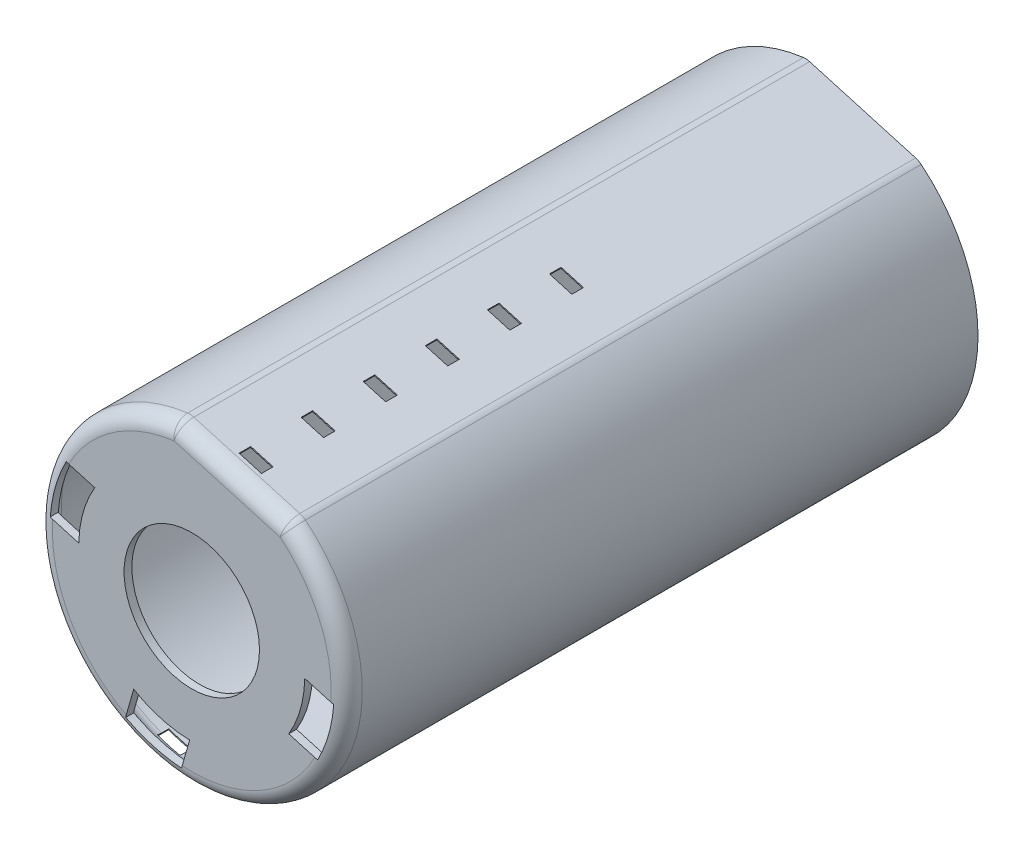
ISO-10303-21;
HEADER;
FILE_DESCRIPTION(('STEP AP214'),'2;1');
FILE_NAME('part.step','',(''),(''),'','','');
FILE_SCHEMA(('AUTOMOTIVE_DESIGN { 1 0 10303 214 1 1 1 1 }'));
ENDSEC;
DATA;
#1=APPLICATION_CONTEXT('core data for automotive mechanical design processes');
#2=APPLICATION_PROTOCOL_DEFINITION('international standard','automotive_design',2000,#1);
#3=PRODUCT_CONTEXT('',#1,'mechanical');
#4=PRODUCT('Part','Part','',(#3));
#5=PRODUCT_RELATED_PRODUCT_CATEGORY('part','',(#4));
#6=PRODUCT_DEFINITION_FORMATION('','',#4);
#7=PRODUCT_DEFINITION_CONTEXT('part definition',#1,'design');
#8=PRODUCT_DEFINITION('design','',#6,#7);
#9=PRODUCT_DEFINITION_SHAPE('','',#8);
#10=(LENGTH_UNIT() NAMED_UNIT(*) SI_UNIT(.MILLI.,.METRE.));
#11=(NAMED_UNIT(*) PLANE_ANGLE_UNIT() SI_UNIT($,.RADIAN.));
#12=(NAMED_UNIT(*) SI_UNIT($,.STERADIAN.) SOLID_ANGLE_UNIT());
#13=UNCERTAINTY_MEASURE_WITH_UNIT(LENGTH_MEASURE(1.E-05),#10,'distance_accuracy_value','');
#14=(GEOMETRIC_REPRESENTATION_CONTEXT(3) GLOBAL_UNCERTAINTY_ASSIGNED_CONTEXT((#13)) GLOBAL_UNIT_ASSIGNED_CONTEXT((#10,
#11,#12)) REPRESENTATION_CONTEXT('',''));
#15=CARTESIAN_POINT('',(0.,0.,0.));
#16=DIRECTION('',(0.,0.,1.));
#17=DIRECTION('',(1.,0.,0.));
#18=AXIS2_PLACEMENT_3D('',#15,#16,#17);
#19=CARTESIAN_POINT('',(0.,0.,20.));
#20=DIRECTION('',(0.,0.,1.));
#21=DIRECTION('',(1.,0.,0.));
#22=AXIS2_PLACEMENT_3D('',#19,#20,#21);
#23=PLANE('',#22);
#24=DIRECTION('',(0.96126169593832,-0.275637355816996,0.));
#25=VECTOR('',#24,1.);
#26=CARTESIAN_POINT('',(-365.323246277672,26.7322974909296,20.));
#27=LINE('',#26,#25);
#28=CARTESIAN_POINT('',(-358.445840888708,24.7602332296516,20.));
#29=VERTEX_POINT('',#28);
#30=CARTESIAN_POINT('',(-291.248230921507,5.49162863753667,20.));
#31=VERTEX_POINT('',#30);
#32=EDGE_CURVE('E813',#29,#31,#27,.T.);
#33=ORIENTED_EDGE('',*,*,#32,.F.);
#34=CARTESIAN_POINT('',(0.,0.,20.));
#35=DIRECTION('',(0.,0.,1.));
#36=DIRECTION('',(1.,0.,0.));
#37=AXIS2_PLACEMENT_3D('',#34,#35,#36);
#38=CIRCLE('',#37,359.3);
#39=CARTESIAN_POINT('',(-168.949487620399,-317.100237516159,20.));
#40=VERTEX_POINT('',#39);
#41=EDGE_CURVE('E1018',#29,#40,#38,.T.);
#42=ORIENTED_EDGE('',*,*,#41,.T.);
#43=DIRECTION('',(-0.275637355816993,-0.961261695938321,0.));
#44=VECTOR('',#43,1.);
#45=CARTESIAN_POINT('',(-170.921551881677,-323.977642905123,20.));
#46=LINE('',#45,#44);
#47=CARTESIAN_POINT('',(-149.680883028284,-249.902627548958,20.));
#48=VERTEX_POINT('',#47);
#49=EDGE_CURVE('E844',#48,#40,#46,.T.);
#50=ORIENTED_EDGE('',*,*,#49,.F.);
#51=CARTESIAN_POINT('',(0.,0.,20.));
#52=DIRECTION('',(0.,0.,-1.));
#53=DIRECTION('',(1.,0.,0.));
#54=AXIS2_PLACEMENT_3D('',#51,#52,#53);
#55=CIRCLE('',#54,291.3);
#56=CARTESIAN_POINT('',(-5.49162863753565,-291.248230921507,20.));
#57=VERTEX_POINT('',#56);
#58=EDGE_CURVE('E841',#57,#48,#55,.T.);
#59=ORIENTED_EDGE('',*,*,#58,.F.);
#60=DIRECTION('',(0.275637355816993,0.961261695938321,0.));
#61=VECTOR('',#60,1.);
#62=CARTESIAN_POINT('',(-26.7322974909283,-365.323246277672,20.));
#63=LINE('',#62,#61);
#64=CARTESIAN_POINT('',(-24.7602332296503,-358.445840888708,20.));
#65=VERTEX_POINT('',#64);
#66=EDGE_CURVE('E832',#65,#57,#63,.T.);
#67=ORIENTED_EDGE('',*,*,#66,.F.);
#68=CARTESIAN_POINT('',(0.,0.,20.));
#69=DIRECTION('',(0.,0.,1.));
#70=DIRECTION('',(1.,0.,0.));
#71=AXIS2_PLACEMENT_3D('',#68,#69,#70);
#72=CIRCLE('',#71,359.3);
#73=CARTESIAN_POINT('',(317.100237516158,-168.949487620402,20.));
#74=VERTEX_POINT('',#73);
#75=EDGE_CURVE('E1016',#65,#74,#72,.T.);
#76=ORIENTED_EDGE('',*,*,#75,.T.);
#77=DIRECTION('',(0.961261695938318,-0.275637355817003,0.));
#78=VECTOR('',#77,1.);
#79=CARTESIAN_POINT('',(323.977642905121,-170.92155188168,20.));
#80=LINE('',#79,#78);
#81=CARTESIAN_POINT('',(249.902627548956,-149.680883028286,20.));
#82=VERTEX_POINT('',#81);
#83=EDGE_CURVE('E806',#82,#74,#80,.T.);
#84=ORIENTED_EDGE('',*,*,#83,.F.);
#85=CARTESIAN_POINT('',(0.,0.,20.));
#86=DIRECTION('',(0.,0.,-1.));
#87=DIRECTION('',(0.,1.,0.));
#88=AXIS2_PLACEMENT_3D('',#85,#86,#87);
#89=CIRCLE('',#88,291.3);
#90=CARTESIAN_POINT('',(291.248230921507,-5.4916286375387,20.));
#91=VERTEX_POINT('',#90);
#92=EDGE_CURVE('E803',#91,#82,#89,.T.);
#93=ORIENTED_EDGE('',*,*,#92,.F.);
#94=DIRECTION('',(-0.961261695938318,0.275637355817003,0.));
#95=VECTOR('',#94,1.);
#96=CARTESIAN_POINT('',(365.323246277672,-26.7322974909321,20.));
#97=LINE('',#96,#95);
#98=CARTESIAN_POINT('',(358.445840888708,-24.760233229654,20.));
#99=VERTEX_POINT('',#98);
#100=EDGE_CURVE('E801',#99,#91,#97,.T.);
#101=ORIENTED_EDGE('',*,*,#100,.F.);
#102=CARTESIAN_POINT('',(0.,0.,20.));
#103=DIRECTION('',(0.,0.,1.));
#104=DIRECTION('',(1.,0.,0.));
#105=AXIS2_PLACEMENT_3D('',#102,#103,#104);
#106=CIRCLE('',#105,359.3);
#107=CARTESIAN_POINT('',(227.569413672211,278.044334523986,20.));
#108=VERTEX_POINT('',#107);
#109=EDGE_CURVE('E1009',#99,#108,#106,.T.);
#110=ORIENTED_EDGE('',*,*,#109,.T.);
#111=DIRECTION('',(0.961261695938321,-0.275637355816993,0.));
#112=VECTOR('',#111,1.);
#113=CARTESIAN_POINT('',(-45.6487588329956,356.388384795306,20.));
#114=LINE('',#113,#112);
#115=CARTESIAN_POINT('',(-45.6487588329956,356.388384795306,20.));
#116=VERTEX_POINT('',#115);
#117=EDGE_CURVE('E1011',#108,#116,#114,.F.);
#118=ORIENTED_EDGE('',*,*,#117,.T.);
#119=CARTESIAN_POINT('',(0.,0.,20.));
#120=DIRECTION('',(0.,0.,1.));
#121=DIRECTION('',(1.,0.,0.));
#122=AXIS2_PLACEMENT_3D('',#119,#120,#121);
#123=CIRCLE('',#122,359.3);
#124=CARTESIAN_POINT('',(-317.100237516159,168.9494876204,20.));
#125=VERTEX_POINT('',#124);
#126=EDGE_CURVE('E1014',#116,#125,#123,.T.);
#127=ORIENTED_EDGE('',*,*,#126,.T.);
#128=DIRECTION('',(-0.96126169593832,0.275637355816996,0.));
#129=VECTOR('',#128,1.);
#130=CARTESIAN_POINT('',(-323.977642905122,170.921551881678,20.));
#131=LINE('',#130,#129);
#132=CARTESIAN_POINT('',(-249.902627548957,149.680883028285,20.));
#133=VERTEX_POINT('',#132);
#134=EDGE_CURVE('E825',#133,#125,#131,.T.);
#135=ORIENTED_EDGE('',*,*,#134,.F.);
#136=CARTESIAN_POINT('',(0.,0.,20.));
#137=DIRECTION('',(0.,0.,-1.));
#138=DIRECTION('',(0.,-1.,0.));
#139=AXIS2_PLACEMENT_3D('',#136,#137,#138);
#140=CIRCLE('',#139,291.3);
#141=EDGE_CURVE('E822',#31,#133,#140,.T.);
#142=ORIENTED_EDGE('',*,*,#141,.F.);
#143=EDGE_LOOP('',(#33,#42,#50,#59,#67,#76,#84,#93,#101,#110,#118,#127,#135,#142));
#144=FACE_BOUND('',#143,.T.);
#145=CARTESIAN_POINT('',(0.,0.,20.));
#146=DIRECTION('',(0.,0.,1.));
#147=DIRECTION('',(1.,0.,0.));
#148=AXIS2_PLACEMENT_3D('',#145,#146,#147);
#149=CIRCLE('',#148,174.5);
#150=CARTESIAN_POINT('',(174.5,0.,20.));
#151=VERTEX_POINT('',#150);
#152=EDGE_CURVE('E871',#151,#151,#149,.T.);
#153=ORIENTED_EDGE('',*,*,#152,.F.);
#154=EDGE_LOOP('',(#153));
#155=FACE_BOUND('',#154,.T.);
#156=ADVANCED_FACE('F36',(#144,#155),#23,.T.);
#157=CARTESIAN_POINT('',(0.,0.,0.));
#158=DIRECTION('',(0.,0.,1.));
#159=DIRECTION('',(1.,0.,0.));
#160=AXIS2_PLACEMENT_3D('',#157,#158,#159);
#161=PLANE('',#160);
#162=DIRECTION('',(0.961261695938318,-0.275637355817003,0.));
#163=VECTOR('',#162,1.);
#164=CARTESIAN_POINT('',(-20.6728016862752,-72.0946271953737,0.));
#165=LINE('',#164,#163);
#166=CARTESIAN_POINT('',(249.902627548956,-149.680883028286,0.));
#167=VERTEX_POINT('',#166);
#168=CARTESIAN_POINT('',(314.150929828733,-168.10378724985,0.));
#169=VERTEX_POINT('',#168);
#170=EDGE_CURVE('E897',#167,#169,#165,.T.);
#171=ORIENTED_EDGE('',*,*,#170,.T.);
#172=CARTESIAN_POINT('',(0.,0.,0.));
#173=DIRECTION('',(0.,0.,1.));
#174=DIRECTION('',(1.,0.,0.));
#175=AXIS2_PLACEMENT_3D('',#172,#173,#174);
#176=CIRCLE('',#175,356.3);
#177=CARTESIAN_POINT('',(-23.9145328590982,-355.496533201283,0.));
#178=VERTEX_POINT('',#177);
#179=EDGE_CURVE('E997',#169,#178,#176,.F.);
#180=ORIENTED_EDGE('',*,*,#179,.T.);
#181=DIRECTION('',(0.275637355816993,0.961261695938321,0.));
#182=VECTOR('',#181,1.);
#183=CARTESIAN_POINT('',(72.0946271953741,-20.6728016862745,0.));
#184=LINE('',#183,#182);
#185=CARTESIAN_POINT('',(-5.49162863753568,-291.248230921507,0.));
#186=VERTEX_POINT('',#185);
#187=EDGE_CURVE('E874',#178,#186,#184,.T.);
#188=ORIENTED_EDGE('',*,*,#187,.T.);
#189=CARTESIAN_POINT('',(0.,0.,0.));
#190=DIRECTION('',(0.,0.,1.));
#191=DIRECTION('',(1.,0.,0.));
#192=AXIS2_PLACEMENT_3D('',#189,#190,#191);
#193=CIRCLE('',#192,291.3);
#194=CARTESIAN_POINT('',(-149.680883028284,-249.902627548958,0.));
#195=VERTEX_POINT('',#194);
#196=EDGE_CURVE('E878',#186,#195,#193,.F.);
#197=ORIENTED_EDGE('',*,*,#196,.T.);
#198=DIRECTION('',(-0.275637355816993,-0.961261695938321,0.));
#199=VECTOR('',#198,1.);
#200=CARTESIAN_POINT('',(-72.094627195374,20.6728016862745,0.));
#201=LINE('',#200,#199);
#202=CARTESIAN_POINT('',(-168.103787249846,-314.150929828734,0.));
#203=VERTEX_POINT('',#202);
#204=EDGE_CURVE('E881',#195,#203,#201,.T.);
#205=ORIENTED_EDGE('',*,*,#204,.T.);
#206=CARTESIAN_POINT('',(0.,0.,0.));
#207=DIRECTION('',(0.,0.,1.));
#208=DIRECTION('',(1.,0.,0.));
#209=AXIS2_PLACEMENT_3D('',#206,#207,#208);
#210=CIRCLE('',#209,356.3);
#211=CARTESIAN_POINT('',(-355.496533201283,23.9145328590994,0.));
#212=VERTEX_POINT('',#211);
#213=EDGE_CURVE('E995',#203,#212,#210,.F.);
#214=ORIENTED_EDGE('',*,*,#213,.T.);
#215=DIRECTION('',(0.96126169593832,-0.275637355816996,0.));
#216=VECTOR('',#215,1.);
#217=CARTESIAN_POINT('',(-20.6728016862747,-72.094627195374,0.));
#218=LINE('',#217,#216);
#219=CARTESIAN_POINT('',(-291.248230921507,5.49162863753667,0.));
#220=VERTEX_POINT('',#219);
#221=EDGE_CURVE('E884',#212,#220,#218,.T.);
#222=ORIENTED_EDGE('',*,*,#221,.T.);
#223=CARTESIAN_POINT('',(0.,0.,0.));
#224=DIRECTION('',(0.,0.,1.));
#225=DIRECTION('',(1.,0.,0.));
#226=AXIS2_PLACEMENT_3D('',#223,#224,#225);
#227=CIRCLE('',#226,291.3);
#228=CARTESIAN_POINT('',(-249.902627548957,149.680883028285,0.));
#229=VERTEX_POINT('',#228);
#230=EDGE_CURVE('E886',#220,#229,#227,.F.);
#231=ORIENTED_EDGE('',*,*,#230,.T.);
#232=DIRECTION('',(-0.96126169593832,0.275637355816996,0.));
#233=VECTOR('',#232,1.);
#234=CARTESIAN_POINT('',(20.6728016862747,72.0946271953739,0.));
#235=LINE('',#234,#233);
#236=CARTESIAN_POINT('',(-314.150929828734,168.103787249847,0.));
#237=VERTEX_POINT('',#236);
#238=EDGE_CURVE('E889',#229,#237,#235,.T.);
#239=ORIENTED_EDGE('',*,*,#238,.T.);
#240=CARTESIAN_POINT('',(0.,0.,0.));
#241=DIRECTION('',(0.,0.,1.));
#242=DIRECTION('',(1.,0.,0.));
#243=AXIS2_PLACEMENT_3D('',#240,#241,#242);
#244=CIRCLE('',#243,356.3);
#245=CARTESIAN_POINT('',(-45.8798156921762,353.333740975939,0.));
#246=VERTEX_POINT('',#245);
#247=EDGE_CURVE('E990',#237,#246,#244,.F.);
#248=ORIENTED_EDGE('',*,*,#247,.T.);
#249=DIRECTION('',(0.961261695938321,-0.275637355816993,0.));
#250=VECTOR('',#249,1.);
#251=CARTESIAN_POINT('',(90.1334153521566,314.332574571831,0.));
#252=LINE('',#251,#250);
#253=CARTESIAN_POINT('',(226.146646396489,275.331408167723,0.));
#254=VERTEX_POINT('',#253);
#255=EDGE_CURVE('E988',#246,#254,#252,.T.);
#256=ORIENTED_EDGE('',*,*,#255,.T.);
#257=CARTESIAN_POINT('',(0.,0.,0.));
#258=DIRECTION('',(0.,0.,1.));
#259=DIRECTION('',(1.,0.,0.));
#260=AXIS2_PLACEMENT_3D('',#257,#258,#259);
#261=CIRCLE('',#260,356.3);
#262=CARTESIAN_POINT('',(355.496533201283,-23.9145328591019,0.));
#263=VERTEX_POINT('',#262);
#264=EDGE_CURVE('E992',#254,#263,#261,.F.);
#265=ORIENTED_EDGE('',*,*,#264,.T.);
#266=DIRECTION('',(-0.961261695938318,0.275637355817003,0.));
#267=VECTOR('',#266,1.);
#268=CARTESIAN_POINT('',(20.6728016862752,72.0946271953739,0.));
#269=LINE('',#268,#267);
#270=CARTESIAN_POINT('',(291.248230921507,-5.4916286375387,0.));
#271=VERTEX_POINT('',#270);
#272=EDGE_CURVE('E892',#263,#271,#269,.T.);
#273=ORIENTED_EDGE('',*,*,#272,.T.);
#274=CARTESIAN_POINT('',(0.,0.,0.));
#275=DIRECTION('',(0.,0.,1.));
#276=DIRECTION('',(1.,0.,0.));
#277=AXIS2_PLACEMENT_3D('',#274,#275,#276);
#278=CIRCLE('',#277,291.3);
#279=EDGE_CURVE('E894',#271,#167,#278,.F.);
#280=ORIENTED_EDGE('',*,*,#279,.T.);
#281=EDGE_LOOP('',(#171,#180,#188,#197,#205,#214,#222,#231,#239,#248,#256,#265,#273,#280));
#282=FACE_BOUND('',#281,.T.);
#283=CARTESIAN_POINT('',(0.,0.,0.));
#284=DIRECTION('',(0.,0.,1.));
#285=DIRECTION('',(1.,0.,0.));
#286=AXIS2_PLACEMENT_3D('',#283,#284,#285);
#287=CIRCLE('',#286,174.5);
#288=CARTESIAN_POINT('',(174.5,0.,0.));
#289=VERTEX_POINT('',#288);
#290=EDGE_CURVE('E870',#289,#289,#287,.T.);
#291=ORIENTED_EDGE('',*,*,#290,.T.);
#292=EDGE_LOOP('',(#291));
#293=FACE_BOUND('',#292,.T.);
#294=ADVANCED_FACE('F1199',(#282,#293),#161,.F.);
#295=CARTESIAN_POINT('',(0.,0.,20.));
#296=DIRECTION('',(0.,0.,-1.));
#297=DIRECTION('',(-1.,0.,0.));
#298=AXIS2_PLACEMENT_3D('',#295,#296,#297);
#299=CYLINDRICAL_SURFACE('',#298,399.3);
#300=CARTESIAN_POINT('',(0.,0.,-858.85));
#301=DIRECTION('',(0.,0.,-1.));
#302=DIRECTION('',(-1.,0.,0.));
#303=AXIS2_PLACEMENT_3D('',#300,#301,#302);
#304=CIRCLE('',#303,399.3);
#305=CARTESIAN_POINT('',(-80.9130700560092,-391.016067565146,-858.85));
#306=VERTEX_POINT('',#305);
#307=CARTESIAN_POINT('',(-138.588771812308,-374.477826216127,-858.85));
#308=VERTEX_POINT('',#307);
#309=EDGE_CURVE('E573',#306,#308,#304,.T.);
#310=ORIENTED_EDGE('',*,*,#309,.T.);
#311=DIRECTION('',(0.,0.,-1.));
#312=VECTOR('',#311,1.);
#313=CARTESIAN_POINT('',(-138.588771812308,-374.477826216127,20.));
#314=LINE('',#313,#312);
#315=CARTESIAN_POINT('',(-138.588771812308,-374.477826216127,-828.85));
#316=VERTEX_POINT('',#315);
#317=EDGE_CURVE('E579',#308,#316,#314,.F.);
#318=ORIENTED_EDGE('',*,*,#317,.T.);
#319=CARTESIAN_POINT('',(0.,0.,-828.85));
#320=DIRECTION('',(0.,0.,1.));
#321=DIRECTION('',(1.,0.,0.));
#322=AXIS2_PLACEMENT_3D('',#319,#320,#321);
#323=CIRCLE('',#322,399.3);
#324=CARTESIAN_POINT('',(-80.9130700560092,-391.016067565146,-828.85));
#325=VERTEX_POINT('',#324);
#326=EDGE_CURVE('E563',#316,#325,#323,.T.);
#327=ORIENTED_EDGE('',*,*,#326,.T.);
#328=DIRECTION('',(0.,0.,-1.));
#329=VECTOR('',#328,1.);
#330=CARTESIAN_POINT('',(-80.9130700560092,-391.016067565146,20.));
#331=LINE('',#330,#329);
#332=EDGE_CURVE('E568',#325,#306,#331,.T.);
#333=ORIENTED_EDGE('',*,*,#332,.T.);
#334=EDGE_LOOP('',(#310,#318,#327,#333));
#335=FACE_BOUND('',#334,.T.);
#336=CARTESIAN_POINT('',(0.,0.,-698.85));
#337=DIRECTION('',(0.,0.,-1.));
#338=DIRECTION('',(-1.,0.,0.));
#339=AXIS2_PLACEMENT_3D('',#336,#337,#338);
#340=CIRCLE('',#339,399.3);
#341=CARTESIAN_POINT('',(-80.9130700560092,-391.016067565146,-698.85));
#342=VERTEX_POINT('',#341);
#343=CARTESIAN_POINT('',(-138.588771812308,-374.477826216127,-698.85));
#344=VERTEX_POINT('',#343);
#345=EDGE_CURVE('E618',#342,#344,#340,.T.);
#346=ORIENTED_EDGE('',*,*,#345,.T.);
#347=DIRECTION('',(0.,0.,-1.));
#348=VECTOR('',#347,1.);
#349=CARTESIAN_POINT('',(-138.588771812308,-374.477826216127,20.));
#350=LINE('',#349,#348);
#351=CARTESIAN_POINT('',(-138.588771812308,-374.477826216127,-668.85));
#352=VERTEX_POINT('',#351);
#353=EDGE_CURVE('E624',#344,#352,#350,.F.);
#354=ORIENTED_EDGE('',*,*,#353,.T.);
#355=CARTESIAN_POINT('',(0.,0.,-668.85));
#356=DIRECTION('',(0.,0.,1.));
#357=DIRECTION('',(1.,0.,0.));
#358=AXIS2_PLACEMENT_3D('',#355,#356,#357);
#359=CIRCLE('',#358,399.3);
#360=CARTESIAN_POINT('',(-80.9130700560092,-391.016067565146,-668.85));
#361=VERTEX_POINT('',#360);
#362=EDGE_CURVE('E608',#352,#361,#359,.T.);
#363=ORIENTED_EDGE('',*,*,#362,.T.);
#364=DIRECTION('',(0.,0.,-1.));
#365=VECTOR('',#364,1.);
#366=CARTESIAN_POINT('',(-80.9130700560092,-391.016067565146,20.));
#367=LINE('',#366,#365);
#368=EDGE_CURVE('E613',#361,#342,#367,.T.);
#369=ORIENTED_EDGE('',*,*,#368,.T.);
#370=EDGE_LOOP('',(#346,#354,#363,#369));
#371=FACE_BOUND('',#370,.T.);
#372=CARTESIAN_POINT('',(0.,0.,-538.85));
#373=DIRECTION('',(0.,0.,-1.));
#374=DIRECTION('',(-1.,0.,0.));
#375=AXIS2_PLACEMENT_3D('',#372,#373,#374);
#376=CIRCLE('',#375,399.3);
#377=CARTESIAN_POINT('',(-80.9130700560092,-391.016067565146,-538.85));
#378=VERTEX_POINT('',#377);
#379=CARTESIAN_POINT('',(-138.588771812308,-374.477826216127,-538.85));
#380=VERTEX_POINT('',#379);
#381=EDGE_CURVE('E663',#378,#380,#376,.T.);
#382=ORIENTED_EDGE('',*,*,#381,.T.);
#383=DIRECTION('',(0.,0.,-1.));
#384=VECTOR('',#383,1.);
#385=CARTESIAN_POINT('',(-138.588771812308,-374.477826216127,20.));
#386=LINE('',#385,#384);
#387=CARTESIAN_POINT('',(-138.588771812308,-374.477826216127,-508.85));
#388=VERTEX_POINT('',#387);
#389=EDGE_CURVE('E669',#380,#388,#386,.F.);
#390=ORIENTED_EDGE('',*,*,#389,.T.);
#391=CARTESIAN_POINT('',(0.,0.,-508.85));
#392=DIRECTION('',(0.,0.,1.));
#393=DIRECTION('',(1.,0.,0.));
#394=AXIS2_PLACEMENT_3D('',#391,#392,#393);
#395=CIRCLE('',#394,399.3);
#396=CARTESIAN_POINT('',(-80.9130700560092,-391.016067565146,-508.85));
#397=VERTEX_POINT('',#396);
#398=EDGE_CURVE('E653',#388,#397,#395,.T.);
#399=ORIENTED_EDGE('',*,*,#398,.T.);
#400=DIRECTION('',(0.,0.,-1.));
#401=VECTOR('',#400,1.);
#402=CARTESIAN_POINT('',(-80.9130700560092,-391.016067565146,20.));
#403=LINE('',#402,#401);
#404=EDGE_CURVE('E658',#397,#378,#403,.T.);
#405=ORIENTED_EDGE('',*,*,#404,.T.);
#406=EDGE_LOOP('',(#382,#390,#399,#405));
#407=FACE_BOUND('',#406,.T.);
#408=CARTESIAN_POINT('',(0.,0.,-378.85));
#409=DIRECTION('',(0.,0.,-1.));
#410=DIRECTION('',(-1.,0.,0.));
#411=AXIS2_PLACEMENT_3D('',#408,#409,#410);
#412=CIRCLE('',#411,399.3);
#413=CARTESIAN_POINT('',(-80.9130700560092,-391.016067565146,-378.85));
#414=VERTEX_POINT('',#413);
#415=CARTESIAN_POINT('',(-138.588771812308,-374.477826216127,-378.85));
#416=VERTEX_POINT('',#415);
#417=EDGE_CURVE('E708',#414,#416,#412,.T.);
#418=ORIENTED_EDGE('',*,*,#417,.T.);
#419=DIRECTION('',(0.,0.,-1.));
#420=VECTOR('',#419,1.);
#421=CARTESIAN_POINT('',(-138.588771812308,-374.477826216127,20.));
#422=LINE('',#421,#420);
#423=CARTESIAN_POINT('',(-138.588771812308,-374.477826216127,-348.85));
#424=VERTEX_POINT('',#423);
#425=EDGE_CURVE('E714',#416,#424,#422,.F.);
#426=ORIENTED_EDGE('',*,*,#425,.T.);
#427=CARTESIAN_POINT('',(0.,0.,-348.85));
#428=DIRECTION('',(0.,0.,1.));
#429=DIRECTION('',(1.,0.,0.));
#430=AXIS2_PLACEMENT_3D('',#427,#428,#429);
#431=CIRCLE('',#430,399.3);
#432=CARTESIAN_POINT('',(-80.9130700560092,-391.016067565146,-348.85));
#433=VERTEX_POINT('',#432);
#434=EDGE_CURVE('E698',#424,#433,#431,.T.);
#435=ORIENTED_EDGE('',*,*,#434,.T.);
#436=DIRECTION('',(0.,0.,-1.));
#437=VECTOR('',#436,1.);
#438=CARTESIAN_POINT('',(-80.9130700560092,-391.016067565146,20.));
#439=LINE('',#438,#437);
#440=EDGE_CURVE('E703',#433,#414,#439,.T.);
#441=ORIENTED_EDGE('',*,*,#440,.T.);
#442=EDGE_LOOP('',(#418,#426,#435,#441));
#443=FACE_BOUND('',#442,.T.);
#444=CARTESIAN_POINT('',(0.,0.,-218.85));
#445=DIRECTION('',(0.,0.,-1.));
#446=DIRECTION('',(-1.,0.,0.));
#447=AXIS2_PLACEMENT_3D('',#444,#445,#446);
#448=CIRCLE('',#447,399.3);
#449=CARTESIAN_POINT('',(-80.9130700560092,-391.016067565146,-218.85));
#450=VERTEX_POINT('',#449);
#451=CARTESIAN_POINT('',(-138.588771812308,-374.477826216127,-218.85));
#452=VERTEX_POINT('',#451);
#453=EDGE_CURVE('E753',#450,#452,#448,.T.);
#454=ORIENTED_EDGE('',*,*,#453,.T.);
#455=DIRECTION('',(0.,0.,-1.));
#456=VECTOR('',#455,1.);
#457=CARTESIAN_POINT('',(-138.588771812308,-374.477826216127,20.));
#458=LINE('',#457,#456);
#459=CARTESIAN_POINT('',(-138.588771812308,-374.477826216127,-188.85));
#460=VERTEX_POINT('',#459);
#461=EDGE_CURVE('E759',#452,#460,#458,.F.);
#462=ORIENTED_EDGE('',*,*,#461,.T.);
#463=CARTESIAN_POINT('',(0.,0.,-188.85));
#464=DIRECTION('',(0.,0.,1.));
#465=DIRECTION('',(1.,0.,0.));
#466=AXIS2_PLACEMENT_3D('',#463,#464,#465);
#467=CIRCLE('',#466,399.3);
#468=CARTESIAN_POINT('',(-80.9130700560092,-391.016067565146,-188.85));
#469=VERTEX_POINT('',#468);
#470=EDGE_CURVE('E743',#460,#469,#467,.T.);
#471=ORIENTED_EDGE('',*,*,#470,.T.);
#472=DIRECTION('',(0.,0.,-1.));
#473=VECTOR('',#472,1.);
#474=CARTESIAN_POINT('',(-80.9130700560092,-391.016067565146,20.));
#475=LINE('',#474,#473);
#476=EDGE_CURVE('E748',#469,#450,#475,.T.);
#477=ORIENTED_EDGE('',*,*,#476,.T.);
#478=EDGE_LOOP('',(#454,#462,#471,#477));
#479=FACE_BOUND('',#478,.T.);
#480=CARTESIAN_POINT('',(0.,0.,-58.85));
#481=DIRECTION('',(0.,0.,-1.));
#482=DIRECTION('',(-1.,0.,0.));
#483=AXIS2_PLACEMENT_3D('',#480,#481,#482);
#484=CIRCLE('',#483,399.3);
#485=CARTESIAN_POINT('',(-80.9130700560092,-391.016067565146,-58.85));
#486=VERTEX_POINT('',#485);
#487=CARTESIAN_POINT('',(-138.588771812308,-374.477826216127,-58.85));
#488=VERTEX_POINT('',#487);
#489=EDGE_CURVE('E792',#486,#488,#484,.T.);
#490=ORIENTED_EDGE('',*,*,#489,.T.);
#491=DIRECTION('',(0.,0.,-1.));
#492=VECTOR('',#491,1.);
#493=CARTESIAN_POINT('',(-138.588771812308,-374.477826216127,20.));
#494=LINE('',#493,#492);
#495=CARTESIAN_POINT('',(-138.588771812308,-374.477826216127,-28.85));
#496=VERTEX_POINT('',#495);
#497=EDGE_CURVE('E798',#488,#496,#494,.F.);
#498=ORIENTED_EDGE('',*,*,#497,.T.);
#499=CARTESIAN_POINT('',(0.,0.,-28.85));
#500=DIRECTION('',(0.,0.,1.));
#501=DIRECTION('',(1.,0.,0.));
#502=AXIS2_PLACEMENT_3D('',#499,#500,#501);
#503=CIRCLE('',#502,399.3);
#504=CARTESIAN_POINT('',(-80.9130700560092,-391.016067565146,-28.85));
#505=VERTEX_POINT('',#504);
#506=EDGE_CURVE('E782',#496,#505,#503,.T.);
#507=ORIENTED_EDGE('',*,*,#506,.T.);
#508=DIRECTION('',(0.,0.,-1.));
#509=VECTOR('',#508,1.);
#510=CARTESIAN_POINT('',(-80.9130700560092,-391.016067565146,20.));
#511=LINE('',#510,#509);
#512=EDGE_CURVE('E787',#505,#486,#511,.T.);
#513=ORIENTED_EDGE('',*,*,#512,.T.);
#514=EDGE_LOOP('',(#490,#498,#507,#513));
#515=FACE_BOUND('',#514,.T.);
#516=DIRECTION('',(0.,0.,-1.));
#517=VECTOR('',#516,1.);
#518=CARTESIAN_POINT('',(252.904166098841,308.99833781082,20.));
#519=LINE('',#518,#517);
#520=CARTESIAN_POINT('',(252.904166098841,308.99833781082,-1607.2));
#521=VERTEX_POINT('',#520);
#522=CARTESIAN_POINT('',(252.904166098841,308.99833781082,-20.));
#523=VERTEX_POINT('',#522);
#524=EDGE_CURVE('E962',#521,#523,#519,.F.);
#525=ORIENTED_EDGE('',*,*,#524,.T.);
#526=CARTESIAN_POINT('',(0.,0.,-20.));
#527=DIRECTION('',(0.,0.,1.));
#528=DIRECTION('',(1.,0.,0.));
#529=AXIS2_PLACEMENT_3D('',#526,#527,#528);
#530=CIRCLE('',#529,399.3);
#531=CARTESIAN_POINT('',(-50.7307247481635,396.064241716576,-20.));
#532=VERTEX_POINT('',#531);
#533=EDGE_CURVE('E1177',#523,#532,#530,.F.);
#534=ORIENTED_EDGE('',*,*,#533,.T.);
#535=DIRECTION('',(0.,0.,-1.));
#536=VECTOR('',#535,1.);
#537=CARTESIAN_POINT('',(-50.7307247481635,396.064241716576,20.));
#538=LINE('',#537,#536);
#539=CARTESIAN_POINT('',(-50.7307247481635,396.064241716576,-1607.2));
#540=VERTEX_POINT('',#539);
#541=EDGE_CURVE('E960',#532,#540,#538,.T.);
#542=ORIENTED_EDGE('',*,*,#541,.T.);
#543=CARTESIAN_POINT('',(0.,0.,-1607.2));
#544=DIRECTION('',(0.,0.,-1.));
#545=DIRECTION('',(-1.,0.,0.));
#546=AXIS2_PLACEMENT_3D('',#543,#544,#545);
#547=CIRCLE('',#546,399.3);
#548=EDGE_CURVE('E864',#521,#540,#547,.T.);
#549=ORIENTED_EDGE('',*,*,#548,.F.);
#550=EDGE_LOOP('',(#525,#534,#542,#549));
#551=FACE_BOUND('',#550,.T.);
#552=ADVANCED_FACE('F1287',(#335,#371,#407,#443,#479,#515,#551),#299,.T.);
#553=CARTESIAN_POINT('',(0.,0.,20.));
#554=DIRECTION('',(0.,0.,-1.));
#555=DIRECTION('',(-1.,0.,0.));
#556=AXIS2_PLACEMENT_3D('',#553,#554,#555);
#557=CYLINDRICAL_SURFACE('',#556,174.5);
#558=ORIENTED_EDGE('',*,*,#152,.T.);
#559=EDGE_LOOP('',(#558));
#560=FACE_BOUND('',#559,.T.);
#561=ORIENTED_EDGE('',*,*,#290,.F.);
#562=EDGE_LOOP('',(#561));
#563=FACE_BOUND('',#562,.T.);
#564=ADVANCED_FACE('F1290',(#560,#563),#557,.F.);
#565=CARTESIAN_POINT('',(-42.3331127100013,397.049616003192,0.));
#566=DIRECTION('',(-0.275637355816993,-0.961261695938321,0.));
#567=DIRECTION('',(0.961261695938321,-0.275637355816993,0.));
#568=AXIS2_PLACEMENT_3D('',#565,#566,#567);
#569=PLANE('',#568);
#570=DIRECTION('',(0.961261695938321,-0.275637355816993,0.));
#571=VECTOR('',#570,1.);
#572=CARTESIAN_POINT('',(73.1479707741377,363.935948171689,-828.85));
#573=LINE('',#572,#571);
#574=CARTESIAN_POINT('',(73.1479707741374,363.935948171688,-828.85));
#575=VERTEX_POINT('',#574);
#576=CARTESIAN_POINT('',(130.823672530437,347.397706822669,-828.85));
#577=VERTEX_POINT('',#576);
#578=EDGE_CURVE('E538',#575,#577,#573,.T.);
#579=ORIENTED_EDGE('',*,*,#578,.F.);
#580=DIRECTION('',(0.,0.,1.));
#581=VECTOR('',#580,1.);
#582=CARTESIAN_POINT('',(73.1479707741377,363.935948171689,-828.85));
#583=LINE('',#582,#581);
#584=CARTESIAN_POINT('',(73.1479707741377,363.935948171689,-858.85));
#585=VERTEX_POINT('',#584);
#586=EDGE_CURVE('E544',#585,#575,#583,.T.);
#587=ORIENTED_EDGE('',*,*,#586,.F.);
#588=DIRECTION('',(-0.961261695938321,0.275637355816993,0.));
#589=VECTOR('',#588,1.);
#590=CARTESIAN_POINT('',(73.1479707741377,363.935948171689,-858.85));
#591=LINE('',#590,#589);
#592=CARTESIAN_POINT('',(130.823672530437,347.397706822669,-858.85));
#593=VERTEX_POINT('',#592);
#594=EDGE_CURVE('E549',#593,#585,#591,.T.);
#595=ORIENTED_EDGE('',*,*,#594,.F.);
#596=DIRECTION('',(0.,0.,-1.));
#597=VECTOR('',#596,1.);
#598=CARTESIAN_POINT('',(130.823672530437,347.397706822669,-828.85));
#599=LINE('',#598,#597);
#600=EDGE_CURVE('E527',#577,#593,#599,.T.);
#601=ORIENTED_EDGE('',*,*,#600,.F.);
#602=EDGE_LOOP('',(#579,#587,#595,#601));
#603=FACE_BOUND('',#602,.T.);
#604=DIRECTION('',(0.961261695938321,-0.275637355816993,0.));
#605=VECTOR('',#604,1.);
#606=CARTESIAN_POINT('',(73.1479707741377,363.935948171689,-668.85));
#607=LINE('',#606,#605);
#608=CARTESIAN_POINT('',(73.1479707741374,363.935948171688,-668.85));
#609=VERTEX_POINT('',#608);
#610=CARTESIAN_POINT('',(130.823672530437,347.397706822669,-668.85));
#611=VERTEX_POINT('',#610);
#612=EDGE_CURVE('E584',#609,#611,#607,.T.);
#613=ORIENTED_EDGE('',*,*,#612,.F.);
#614=DIRECTION('',(0.,0.,1.));
#615=VECTOR('',#614,1.);
#616=CARTESIAN_POINT('',(73.1479707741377,363.935948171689,-668.85));
#617=LINE('',#616,#615);
#618=CARTESIAN_POINT('',(73.1479707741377,363.935948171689,-698.85));
#619=VERTEX_POINT('',#618);
#620=EDGE_CURVE('E582',#619,#609,#617,.T.);
#621=ORIENTED_EDGE('',*,*,#620,.F.);
#622=DIRECTION('',(-0.961261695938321,0.275637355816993,0.));
#623=VECTOR('',#622,1.);
#624=CARTESIAN_POINT('',(73.1479707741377,363.935948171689,-698.85));
#625=LINE('',#624,#623);
#626=CARTESIAN_POINT('',(130.823672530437,347.397706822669,-698.85));
#627=VERTEX_POINT('',#626);
#628=EDGE_CURVE('E590',#627,#619,#625,.T.);
#629=ORIENTED_EDGE('',*,*,#628,.F.);
#630=DIRECTION('',(0.,0.,-1.));
#631=VECTOR('',#630,1.);
#632=CARTESIAN_POINT('',(130.823672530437,347.397706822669,-668.85));
#633=LINE('',#632,#631);
#634=EDGE_CURVE('E587',#611,#627,#633,.T.);
#635=ORIENTED_EDGE('',*,*,#634,.F.);
#636=EDGE_LOOP('',(#613,#621,#629,#635));
#637=FACE_BOUND('',#636,.T.);
#638=DIRECTION('',(0.961261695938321,-0.275637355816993,0.));
#639=VECTOR('',#638,1.);
#640=CARTESIAN_POINT('',(73.1479707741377,363.935948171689,-508.85));
#641=LINE('',#640,#639);
#642=CARTESIAN_POINT('',(73.1479707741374,363.935948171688,-508.85));
#643=VERTEX_POINT('',#642);
#644=CARTESIAN_POINT('',(130.823672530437,347.397706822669,-508.85));
#645=VERTEX_POINT('',#644);
#646=EDGE_CURVE('E629',#643,#645,#641,.T.);
#647=ORIENTED_EDGE('',*,*,#646,.F.);
#648=DIRECTION('',(0.,0.,1.));
#649=VECTOR('',#648,1.);
#650=CARTESIAN_POINT('',(73.1479707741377,363.935948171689,-508.85));
#651=LINE('',#650,#649);
#652=CARTESIAN_POINT('',(73.1479707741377,363.935948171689,-538.85));
#653=VERTEX_POINT('',#652);
#654=EDGE_CURVE('E627',#653,#643,#651,.T.);
#655=ORIENTED_EDGE('',*,*,#654,.F.);
#656=DIRECTION('',(-0.961261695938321,0.275637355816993,0.));
#657=VECTOR('',#656,1.);
#658=CARTESIAN_POINT('',(73.1479707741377,363.935948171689,-538.85));
#659=LINE('',#658,#657);
#660=CARTESIAN_POINT('',(130.823672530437,347.397706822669,-538.85));
#661=VERTEX_POINT('',#660);
#662=EDGE_CURVE('E635',#661,#653,#659,.T.);
#663=ORIENTED_EDGE('',*,*,#662,.F.);
#664=DIRECTION('',(0.,0.,-1.));
#665=VECTOR('',#664,1.);
#666=CARTESIAN_POINT('',(130.823672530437,347.397706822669,-508.85));
#667=LINE('',#666,#665);
#668=EDGE_CURVE('E632',#645,#661,#667,.T.);
#669=ORIENTED_EDGE('',*,*,#668,.F.);
#670=EDGE_LOOP('',(#647,#655,#663,#669));
#671=FACE_BOUND('',#670,.T.);
#672=DIRECTION('',(0.961261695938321,-0.275637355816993,0.));
#673=VECTOR('',#672,1.);
#674=CARTESIAN_POINT('',(73.1479707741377,363.935948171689,-348.85));
#675=LINE('',#674,#673);
#676=CARTESIAN_POINT('',(73.1479707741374,363.935948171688,-348.85));
#677=VERTEX_POINT('',#676);
#678=CARTESIAN_POINT('',(130.823672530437,347.397706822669,-348.85));
#679=VERTEX_POINT('',#678);
#680=EDGE_CURVE('E674',#677,#679,#675,.T.);
#681=ORIENTED_EDGE('',*,*,#680,.F.);
#682=DIRECTION('',(0.,0.,1.));
#683=VECTOR('',#682,1.);
#684=CARTESIAN_POINT('',(73.1479707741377,363.935948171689,-348.85));
#685=LINE('',#684,#683);
#686=CARTESIAN_POINT('',(73.1479707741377,363.935948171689,-378.85));
#687=VERTEX_POINT('',#686);
#688=EDGE_CURVE('E672',#687,#677,#685,.T.);
#689=ORIENTED_EDGE('',*,*,#688,.F.);
#690=DIRECTION('',(-0.961261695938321,0.275637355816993,0.));
#691=VECTOR('',#690,1.);
#692=CARTESIAN_POINT('',(73.1479707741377,363.935948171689,-378.85));
#693=LINE('',#692,#691);
#694=CARTESIAN_POINT('',(130.823672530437,347.397706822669,-378.85));
#695=VERTEX_POINT('',#694);
#696=EDGE_CURVE('E680',#695,#687,#693,.T.);
#697=ORIENTED_EDGE('',*,*,#696,.F.);
#698=DIRECTION('',(0.,0.,-1.));
#699=VECTOR('',#698,1.);
#700=CARTESIAN_POINT('',(130.823672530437,347.397706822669,-348.85));
#701=LINE('',#700,#699);
#702=EDGE_CURVE('E677',#679,#695,#701,.T.);
#703=ORIENTED_EDGE('',*,*,#702,.F.);
#704=EDGE_LOOP('',(#681,#689,#697,#703));
#705=FACE_BOUND('',#704,.T.);
#706=DIRECTION('',(0.961261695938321,-0.275637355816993,0.));
#707=VECTOR('',#706,1.);
#708=CARTESIAN_POINT('',(73.1479707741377,363.935948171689,-188.85));
#709=LINE('',#708,#707);
#710=CARTESIAN_POINT('',(73.1479707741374,363.935948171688,-188.85));
#711=VERTEX_POINT('',#710);
#712=CARTESIAN_POINT('',(130.823672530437,347.397706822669,-188.85));
#713=VERTEX_POINT('',#712);
#714=EDGE_CURVE('E719',#711,#713,#709,.T.);
#715=ORIENTED_EDGE('',*,*,#714,.F.);
#716=DIRECTION('',(0.,0.,1.));
#717=VECTOR('',#716,1.);
#718=CARTESIAN_POINT('',(73.1479707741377,363.935948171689,-188.85));
#719=LINE('',#718,#717);
#720=CARTESIAN_POINT('',(73.1479707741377,363.935948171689,-218.85));
#721=VERTEX_POINT('',#720);
#722=EDGE_CURVE('E717',#721,#711,#719,.T.);
#723=ORIENTED_EDGE('',*,*,#722,.F.);
#724=DIRECTION('',(-0.961261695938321,0.275637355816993,0.));
#725=VECTOR('',#724,1.);
#726=CARTESIAN_POINT('',(73.1479707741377,363.935948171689,-218.85));
#727=LINE('',#726,#725);
#728=CARTESIAN_POINT('',(130.823672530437,347.397706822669,-218.85));
#729=VERTEX_POINT('',#728);
#730=EDGE_CURVE('E725',#729,#721,#727,.T.);
#731=ORIENTED_EDGE('',*,*,#730,.F.);
#732=DIRECTION('',(0.,0.,-1.));
#733=VECTOR('',#732,1.);
#734=CARTESIAN_POINT('',(130.823672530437,347.397706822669,-188.85));
#735=LINE('',#734,#733);
#736=EDGE_CURVE('E722',#713,#729,#735,.T.);
#737=ORIENTED_EDGE('',*,*,#736,.F.);
#738=EDGE_LOOP('',(#715,#723,#731,#737));
#739=FACE_BOUND('',#738,.T.);
#740=DIRECTION('',(0.961261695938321,-0.275637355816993,0.));
#741=VECTOR('',#740,1.);
#742=CARTESIAN_POINT('',(73.1479707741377,363.935948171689,-28.85));
#743=LINE('',#742,#741);
#744=CARTESIAN_POINT('',(73.1479707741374,363.935948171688,-28.85));
#745=VERTEX_POINT('',#744);
#746=CARTESIAN_POINT('',(130.823672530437,347.397706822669,-28.85));
#747=VERTEX_POINT('',#746);
#748=EDGE_CURVE('E764',#745,#747,#743,.T.);
#749=ORIENTED_EDGE('',*,*,#748,.F.);
#750=DIRECTION('',(0.,0.,1.));
#751=VECTOR('',#750,1.);
#752=CARTESIAN_POINT('',(73.1479707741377,363.935948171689,-28.85));
#753=LINE('',#752,#751);
#754=CARTESIAN_POINT('',(73.1479707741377,363.935948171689,-58.85));
#755=VERTEX_POINT('',#754);
#756=EDGE_CURVE('E762',#755,#745,#753,.T.);
#757=ORIENTED_EDGE('',*,*,#756,.F.);
#758=DIRECTION('',(-0.961261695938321,0.275637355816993,0.));
#759=VECTOR('',#758,1.);
#760=CARTESIAN_POINT('',(73.1479707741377,363.935948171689,-58.85));
#761=LINE('',#760,#759);
#762=CARTESIAN_POINT('',(130.823672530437,347.397706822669,-58.85));
#763=VERTEX_POINT('',#762);
#764=EDGE_CURVE('E769',#763,#755,#761,.T.);
#765=ORIENTED_EDGE('',*,*,#764,.F.);
#766=DIRECTION('',(0.,0.,-1.));
#767=VECTOR('',#766,1.);
#768=CARTESIAN_POINT('',(130.823672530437,347.397706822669,-28.85));
#769=LINE('',#768,#767);
#770=EDGE_CURVE('E766',#747,#763,#769,.T.);
#771=ORIENTED_EDGE('',*,*,#770,.F.);
#772=EDGE_LOOP('',(#749,#757,#765,#771));
#773=FACE_BOUND('',#772,.T.);
#774=DIRECTION('',(0.,0.,-1.));
#775=VECTOR('',#774,1.);
#776=CARTESIAN_POINT('',(-34.6232646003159,394.838852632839,0.));
#777=LINE('',#776,#775);
#778=CARTESIAN_POINT('',(-34.6232646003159,394.838852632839,-1607.2));
#779=VERTEX_POINT('',#778);
#780=CARTESIAN_POINT('',(-34.6232646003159,394.838852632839,-20.));
#781=VERTEX_POINT('',#780);
#782=EDGE_CURVE('E965',#779,#781,#777,.F.);
#783=ORIENTED_EDGE('',*,*,#782,.T.);
#784=DIRECTION('',(0.961261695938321,-0.275637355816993,0.));
#785=VECTOR('',#784,1.);
#786=CARTESIAN_POINT('',(238.594907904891,316.494802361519,-20.));
#787=LINE('',#786,#785);
#788=CARTESIAN_POINT('',(238.59490790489,316.494802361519,-20.));
#789=VERTEX_POINT('',#788);
#790=EDGE_CURVE('E1007',#781,#789,#787,.T.);
#791=ORIENTED_EDGE('',*,*,#790,.T.);
#792=DIRECTION('',(0.,0.,-1.));
#793=VECTOR('',#792,1.);
#794=CARTESIAN_POINT('',(238.59490790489,316.494802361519,0.));
#795=LINE('',#794,#793);
#796=CARTESIAN_POINT('',(238.59490790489,316.494802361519,-1607.2));
#797=VERTEX_POINT('',#796);
#798=EDGE_CURVE('E968',#789,#797,#795,.T.);
#799=ORIENTED_EDGE('',*,*,#798,.T.);
#800=DIRECTION('',(0.961261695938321,-0.275637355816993,0.));
#801=VECTOR('',#800,1.);
#802=CARTESIAN_POINT('',(-42.3331127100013,397.049616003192,-1607.2));
#803=LINE('',#802,#801);
#804=EDGE_CURVE('E867',#779,#797,#803,.T.);
#805=ORIENTED_EDGE('',*,*,#804,.F.);
#806=EDGE_LOOP('',(#783,#791,#799,#805));
#807=FACE_BOUND('',#806,.T.);
#808=ADVANCED_FACE('F546',(#603,#637,#671,#705,#739,#773,#807),#569,.F.);
#809=CARTESIAN_POINT('',(0.,0.,-1607.2));
#810=DIRECTION('',(0.,0.,-1.));
#811=DIRECTION('',(-1.,0.,0.));
#812=AXIS2_PLACEMENT_3D('',#809,#810,#811);
#813=PLANE('',#812);
#814=ORIENTED_EDGE('',*,*,#804,.T.);
#815=CARTESIAN_POINT('',(227.569413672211,278.044334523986,-1607.2));
#816=DIRECTION('',(0.,0.,-1.));
#817=DIRECTION('',(-1.,0.,0.));
#818=AXIS2_PLACEMENT_3D('',#815,#816,#817);
#819=CIRCLE('',#818,40.);
#820=EDGE_CURVE('E972',#797,#521,#819,.T.);
#821=ORIENTED_EDGE('',*,*,#820,.T.);
#822=ORIENTED_EDGE('',*,*,#548,.T.);
#823=CARTESIAN_POINT('',(-45.6487588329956,356.388384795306,-1607.2));
#824=DIRECTION('',(0.,0.,-1.));
#825=DIRECTION('',(-1.,0.,0.));
#826=AXIS2_PLACEMENT_3D('',#823,#824,#825);
#827=CIRCLE('',#826,40.);
#828=EDGE_CURVE('E970',#540,#779,#827,.T.);
#829=ORIENTED_EDGE('',*,*,#828,.T.);
#830=EDGE_LOOP('',(#814,#821,#822,#829));
#831=FACE_BOUND('',#830,.T.);
#832=DIRECTION('',(0.961261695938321,-0.275637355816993,0.));
#833=VECTOR('',#832,1.);
#834=CARTESIAN_POINT('',(-42.5961299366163,394.004136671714,-1607.2));
#835=LINE('',#834,#833);
#836=CARTESIAN_POINT('',(-34.8543214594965,391.784208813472,-1607.2));
#837=VERTEX_POINT('',#836);
#838=CARTESIAN_POINT('',(237.172140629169,313.781876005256,-1607.2));
#839=VERTEX_POINT('',#838);
#840=EDGE_CURVE('E861',#837,#839,#835,.T.);
#841=ORIENTED_EDGE('',*,*,#840,.F.);
#842=CARTESIAN_POINT('',(-45.8798156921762,353.333740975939,-1607.2));
#843=DIRECTION('',(0.,0.,-1.));
#844=DIRECTION('',(-1.,0.,0.));
#845=AXIS2_PLACEMENT_3D('',#842,#843,#844);
#846=CIRCLE('',#845,40.);
#847=CARTESIAN_POINT('',(-51.0305106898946,393.000734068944,-1607.2));
#848=VERTEX_POINT('',#847);
#849=EDGE_CURVE('E976',#837,#848,#846,.F.);
#850=ORIENTED_EDGE('',*,*,#849,.T.);
#851=CARTESIAN_POINT('',(0.,0.,-1607.2));
#852=DIRECTION('',(0.,0.,-1.));
#853=DIRECTION('',(-1.,0.,0.));
#854=AXIS2_PLACEMENT_3D('',#851,#852,#853);
#855=CIRCLE('',#854,396.3);
#856=CARTESIAN_POINT('',(251.534987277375,306.241473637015,-1607.2));
#857=VERTEX_POINT('',#856);
#858=EDGE_CURVE('E851',#857,#848,#855,.T.);
#859=ORIENTED_EDGE('',*,*,#858,.F.);
#860=CARTESIAN_POINT('',(226.146646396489,275.331408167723,-1607.2));
#861=DIRECTION('',(0.,0.,-1.));
#862=DIRECTION('',(-1.,0.,0.));
#863=AXIS2_PLACEMENT_3D('',#860,#861,#862);
#864=CIRCLE('',#863,40.);
#865=EDGE_CURVE('E974',#857,#839,#864,.F.);
#866=ORIENTED_EDGE('',*,*,#865,.T.);
#867=EDGE_LOOP('',(#841,#850,#859,#866));
#868=FACE_BOUND('',#867,.T.);
#869=ADVANCED_FACE('F1335',(#831,#868),#813,.T.);
#870=CARTESIAN_POINT('',(0.,0.,-1607.2));
#871=DIRECTION('',(0.,0.,1.));
#872=DIRECTION('',(1.,0.,0.));
#873=AXIS2_PLACEMENT_3D('',#870,#871,#872);
#874=CYLINDRICAL_SURFACE('',#873,396.3);
#875=DIRECTION('',(0.,0.,1.));
#876=VECTOR('',#875,1.);
#877=CARTESIAN_POINT('',(-137.759498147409,-371.585805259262,-1607.2));
#878=LINE('',#877,#876);
#879=CARTESIAN_POINT('',(-137.759498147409,-371.585805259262,-858.85));
#880=VERTEX_POINT('',#879);
#881=CARTESIAN_POINT('',(-137.759498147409,-371.585805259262,-828.85));
#882=VERTEX_POINT('',#881);
#883=EDGE_CURVE('E576',#880,#882,#878,.T.);
#884=ORIENTED_EDGE('',*,*,#883,.F.);
#885=CARTESIAN_POINT('',(0.,0.,-858.85));
#886=DIRECTION('',(0.,0.,-1.));
#887=DIRECTION('',(-1.,0.,0.));
#888=AXIS2_PLACEMENT_3D('',#885,#886,#887);
#889=CIRCLE('',#888,396.3);
#890=CARTESIAN_POINT('',(-80.0837963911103,-388.124046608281,-858.85));
#891=VERTEX_POINT('',#890);
#892=EDGE_CURVE('E571',#891,#880,#889,.T.);
#893=ORIENTED_EDGE('',*,*,#892,.F.);
#894=DIRECTION('',(0.,0.,1.));
#895=VECTOR('',#894,1.);
#896=CARTESIAN_POINT('',(-80.0837963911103,-388.124046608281,-1607.2));
#897=LINE('',#896,#895);
#898=CARTESIAN_POINT('',(-80.0837963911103,-388.124046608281,-828.85));
#899=VERTEX_POINT('',#898);
#900=EDGE_CURVE('E566',#899,#891,#897,.F.);
#901=ORIENTED_EDGE('',*,*,#900,.F.);
#902=CARTESIAN_POINT('',(0.,0.,-828.85));
#903=DIRECTION('',(0.,0.,1.));
#904=DIRECTION('',(1.,0.,0.));
#905=AXIS2_PLACEMENT_3D('',#902,#903,#904);
#906=CIRCLE('',#905,396.3);
#907=EDGE_CURVE('E561',#882,#899,#906,.T.);
#908=ORIENTED_EDGE('',*,*,#907,.F.);
#909=EDGE_LOOP('',(#884,#893,#901,#908));
#910=FACE_BOUND('',#909,.T.);
#911=DIRECTION('',(0.,0.,1.));
#912=VECTOR('',#911,1.);
#913=CARTESIAN_POINT('',(-137.759498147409,-371.585805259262,-1607.2));
#914=LINE('',#913,#912);
#915=CARTESIAN_POINT('',(-137.759498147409,-371.585805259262,-698.85));
#916=VERTEX_POINT('',#915);
#917=CARTESIAN_POINT('',(-137.759498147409,-371.585805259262,-668.85));
#918=VERTEX_POINT('',#917);
#919=EDGE_CURVE('E621',#916,#918,#914,.T.);
#920=ORIENTED_EDGE('',*,*,#919,.F.);
#921=CARTESIAN_POINT('',(0.,0.,-698.85));
#922=DIRECTION('',(0.,0.,-1.));
#923=DIRECTION('',(-1.,0.,0.));
#924=AXIS2_PLACEMENT_3D('',#921,#922,#923);
#925=CIRCLE('',#924,396.3);
#926=CARTESIAN_POINT('',(-80.0837963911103,-388.124046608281,-698.85));
#927=VERTEX_POINT('',#926);
#928=EDGE_CURVE('E616',#927,#916,#925,.T.);
#929=ORIENTED_EDGE('',*,*,#928,.F.);
#930=DIRECTION('',(0.,0.,1.));
#931=VECTOR('',#930,1.);
#932=CARTESIAN_POINT('',(-80.0837963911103,-388.124046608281,-1607.2));
#933=LINE('',#932,#931);
#934=CARTESIAN_POINT('',(-80.0837963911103,-388.124046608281,-668.85));
#935=VERTEX_POINT('',#934);
#936=EDGE_CURVE('E611',#935,#927,#933,.F.);
#937=ORIENTED_EDGE('',*,*,#936,.F.);
#938=CARTESIAN_POINT('',(0.,0.,-668.85));
#939=DIRECTION('',(0.,0.,1.));
#940=DIRECTION('',(1.,0.,0.));
#941=AXIS2_PLACEMENT_3D('',#938,#939,#940);
#942=CIRCLE('',#941,396.3);
#943=EDGE_CURVE('E606',#918,#935,#942,.T.);
#944=ORIENTED_EDGE('',*,*,#943,.F.);
#945=EDGE_LOOP('',(#920,#929,#937,#944));
#946=FACE_BOUND('',#945,.T.);
#947=DIRECTION('',(0.,0.,1.));
#948=VECTOR('',#947,1.);
#949=CARTESIAN_POINT('',(-137.759498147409,-371.585805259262,-1607.2));
#950=LINE('',#949,#948);
#951=CARTESIAN_POINT('',(-137.759498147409,-371.585805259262,-538.85));
#952=VERTEX_POINT('',#951);
#953=CARTESIAN_POINT('',(-137.759498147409,-371.585805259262,-508.85));
#954=VERTEX_POINT('',#953);
#955=EDGE_CURVE('E666',#952,#954,#950,.T.);
#956=ORIENTED_EDGE('',*,*,#955,.F.);
#957=CARTESIAN_POINT('',(0.,0.,-538.85));
#958=DIRECTION('',(0.,0.,-1.));
#959=DIRECTION('',(-1.,0.,0.));
#960=AXIS2_PLACEMENT_3D('',#957,#958,#959);
#961=CIRCLE('',#960,396.3);
#962=CARTESIAN_POINT('',(-80.0837963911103,-388.124046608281,-538.85));
#963=VERTEX_POINT('',#962);
#964=EDGE_CURVE('E661',#963,#952,#961,.T.);
#965=ORIENTED_EDGE('',*,*,#964,.F.);
#966=DIRECTION('',(0.,0.,1.));
#967=VECTOR('',#966,1.);
#968=CARTESIAN_POINT('',(-80.0837963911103,-388.124046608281,-1607.2));
#969=LINE('',#968,#967);
#970=CARTESIAN_POINT('',(-80.0837963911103,-388.124046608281,-508.85));
#971=VERTEX_POINT('',#970);
#972=EDGE_CURVE('E656',#971,#963,#969,.F.);
#973=ORIENTED_EDGE('',*,*,#972,.F.);
#974=CARTESIAN_POINT('',(0.,0.,-508.85));
#975=DIRECTION('',(0.,0.,1.));
#976=DIRECTION('',(1.,0.,0.));
#977=AXIS2_PLACEMENT_3D('',#974,#975,#976);
#978=CIRCLE('',#977,396.3);
#979=EDGE_CURVE('E651',#954,#971,#978,.T.);
#980=ORIENTED_EDGE('',*,*,#979,.F.);
#981=EDGE_LOOP('',(#956,#965,#973,#980));
#982=FACE_BOUND('',#981,.T.);
#983=DIRECTION('',(0.,0.,1.));
#984=VECTOR('',#983,1.);
#985=CARTESIAN_POINT('',(-137.75949814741,-371.585805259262,-1607.2));
#986=LINE('',#985,#984);
#987=CARTESIAN_POINT('',(-137.75949814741,-371.585805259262,-378.85));
#988=VERTEX_POINT('',#987);
#989=CARTESIAN_POINT('',(-137.75949814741,-371.585805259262,-348.85));
#990=VERTEX_POINT('',#989);
#991=EDGE_CURVE('E711',#988,#990,#986,.T.);
#992=ORIENTED_EDGE('',*,*,#991,.F.);
#993=CARTESIAN_POINT('',(0.,0.,-378.85));
#994=DIRECTION('',(0.,0.,-1.));
#995=DIRECTION('',(-1.,0.,0.));
#996=AXIS2_PLACEMENT_3D('',#993,#994,#995);
#997=CIRCLE('',#996,396.3);
#998=CARTESIAN_POINT('',(-80.0837963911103,-388.124046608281,-378.85));
#999=VERTEX_POINT('',#998);
#1000=EDGE_CURVE('E706',#999,#988,#997,.T.);
#1001=ORIENTED_EDGE('',*,*,#1000,.F.);
#1002=DIRECTION('',(0.,0.,1.));
#1003=VECTOR('',#1002,1.);
#1004=CARTESIAN_POINT('',(-80.0837963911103,-388.124046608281,-1607.2));
#1005=LINE('',#1004,#1003);
#1006=CARTESIAN_POINT('',(-80.0837963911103,-388.124046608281,-348.85));
#1007=VERTEX_POINT('',#1006);
#1008=EDGE_CURVE('E701',#1007,#999,#1005,.F.);
#1009=ORIENTED_EDGE('',*,*,#1008,.F.);
#1010=CARTESIAN_POINT('',(0.,0.,-348.85));
#1011=DIRECTION('',(0.,0.,1.));
#1012=DIRECTION('',(1.,0.,0.));
#1013=AXIS2_PLACEMENT_3D('',#1010,#1011,#1012);
#1014=CIRCLE('',#1013,396.3);
#1015=EDGE_CURVE('E696',#990,#1007,#1014,.T.);
#1016=ORIENTED_EDGE('',*,*,#1015,.F.);
#1017=EDGE_LOOP('',(#992,#1001,#1009,#1016));
#1018=FACE_BOUND('',#1017,.T.);
#1019=DIRECTION('',(0.,0.,1.));
#1020=VECTOR('',#1019,1.);
#1021=CARTESIAN_POINT('',(-137.75949814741,-371.585805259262,-1607.2));
#1022=LINE('',#1021,#1020);
#1023=CARTESIAN_POINT('',(-137.75949814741,-371.585805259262,-218.85));
#1024=VERTEX_POINT('',#1023);
#1025=CARTESIAN_POINT('',(-137.75949814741,-371.585805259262,-188.85));
#1026=VERTEX_POINT('',#1025);
#1027=EDGE_CURVE('E756',#1024,#1026,#1022,.T.);
#1028=ORIENTED_EDGE('',*,*,#1027,.F.);
#1029=CARTESIAN_POINT('',(0.,0.,-218.85));
#1030=DIRECTION('',(0.,0.,-1.));
#1031=DIRECTION('',(-1.,0.,0.));
#1032=AXIS2_PLACEMENT_3D('',#1029,#1030,#1031);
#1033=CIRCLE('',#1032,396.3);
#1034=CARTESIAN_POINT('',(-80.0837963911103,-388.124046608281,-218.85));
#1035=VERTEX_POINT('',#1034);
#1036=EDGE_CURVE('E751',#1035,#1024,#1033,.T.);
#1037=ORIENTED_EDGE('',*,*,#1036,.F.);
#1038=DIRECTION('',(0.,0.,1.));
#1039=VECTOR('',#1038,1.);
#1040=CARTESIAN_POINT('',(-80.0837963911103,-388.124046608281,-1607.2));
#1041=LINE('',#1040,#1039);
#1042=CARTESIAN_POINT('',(-80.0837963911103,-388.124046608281,-188.85));
#1043=VERTEX_POINT('',#1042);
#1044=EDGE_CURVE('E746',#1043,#1035,#1041,.F.);
#1045=ORIENTED_EDGE('',*,*,#1044,.F.);
#1046=CARTESIAN_POINT('',(0.,0.,-188.85));
#1047=DIRECTION('',(0.,0.,1.));
#1048=DIRECTION('',(1.,0.,0.));
#1049=AXIS2_PLACEMENT_3D('',#1046,#1047,#1048);
#1050=CIRCLE('',#1049,396.3);
#1051=EDGE_CURVE('E741',#1026,#1043,#1050,.T.);
#1052=ORIENTED_EDGE('',*,*,#1051,.F.);
#1053=EDGE_LOOP('',(#1028,#1037,#1045,#1052));
#1054=FACE_BOUND('',#1053,.T.);
#1055=DIRECTION('',(0.,0.,1.));
#1056=VECTOR('',#1055,1.);
#1057=CARTESIAN_POINT('',(-51.0305106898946,393.000734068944,-1607.2));
#1058=LINE('',#1057,#1056);
#1059=CARTESIAN_POINT('',(-51.0305106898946,393.000734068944,-40.));
#1060=VERTEX_POINT('',#1059);
#1061=EDGE_CURVE('E955',#848,#1060,#1058,.T.);
#1062=ORIENTED_EDGE('',*,*,#1061,.T.);
#1063=CARTESIAN_POINT('',(0.,0.,-40.));
#1064=DIRECTION('',(0.,0.,1.));
#1065=DIRECTION('',(1.,0.,0.));
#1066=AXIS2_PLACEMENT_3D('',#1063,#1064,#1065);
#1067=CIRCLE('',#1066,396.3);
#1068=CARTESIAN_POINT('',(-137.75949814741,-371.585805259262,-40.));
#1069=VERTEX_POINT('',#1068);
#1070=EDGE_CURVE('E1001',#1060,#1069,#1067,.T.);
#1071=ORIENTED_EDGE('',*,*,#1070,.T.);
#1072=DIRECTION('',(0.,0.,1.));
#1073=VECTOR('',#1072,1.);
#1074=CARTESIAN_POINT('',(-137.75949814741,-371.585805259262,-1607.2));
#1075=LINE('',#1074,#1073);
#1076=CARTESIAN_POINT('',(-137.75949814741,-371.585805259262,-58.8500000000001));
#1077=VERTEX_POINT('',#1076);
#1078=EDGE_CURVE('E795',#1077,#1069,#1075,.T.);
#1079=ORIENTED_EDGE('',*,*,#1078,.F.);
#1080=CARTESIAN_POINT('',(0.,0.,-58.8500000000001));
#1081=DIRECTION('',(0.,0.,-1.));
#1082=DIRECTION('',(-1.,0.,0.));
#1083=AXIS2_PLACEMENT_3D('',#1080,#1081,#1082);
#1084=CIRCLE('',#1083,396.3);
#1085=CARTESIAN_POINT('',(-80.0837963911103,-388.124046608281,-58.85));
#1086=VERTEX_POINT('',#1085);
#1087=EDGE_CURVE('E790',#1086,#1077,#1084,.T.);
#1088=ORIENTED_EDGE('',*,*,#1087,.F.);
#1089=DIRECTION('',(0.,0.,1.));
#1090=VECTOR('',#1089,1.);
#1091=CARTESIAN_POINT('',(-80.0837963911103,-388.124046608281,-1607.2));
#1092=LINE('',#1091,#1090);
#1093=CARTESIAN_POINT('',(-80.0837963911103,-388.124046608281,-40.));
#1094=VERTEX_POINT('',#1093);
#1095=EDGE_CURVE('E785',#1094,#1086,#1092,.F.);
#1096=ORIENTED_EDGE('',*,*,#1095,.F.);
#1097=CARTESIAN_POINT('',(0.,0.,-40.));
#1098=DIRECTION('',(0.,0.,1.));
#1099=DIRECTION('',(1.,0.,0.));
#1100=AXIS2_PLACEMENT_3D('',#1097,#1098,#1099);
#1101=CIRCLE('',#1100,396.3);
#1102=CARTESIAN_POINT('',(251.534987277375,306.241473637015,-40.));
#1103=VERTEX_POINT('',#1102);
#1104=EDGE_CURVE('E999',#1094,#1103,#1101,.T.);
#1105=ORIENTED_EDGE('',*,*,#1104,.T.);
#1106=DIRECTION('',(0.,0.,1.));
#1107=VECTOR('',#1106,1.);
#1108=CARTESIAN_POINT('',(251.534987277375,306.241473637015,-1607.2));
#1109=LINE('',#1108,#1107);
#1110=EDGE_CURVE('E958',#1103,#857,#1109,.F.);
#1111=ORIENTED_EDGE('',*,*,#1110,.T.);
#1112=ORIENTED_EDGE('',*,*,#858,.T.);
#1113=EDGE_LOOP('',(#1062,#1071,#1079,#1088,#1096,#1105,#1111,#1112));
#1114=FACE_BOUND('',#1113,.T.);
#1115=ADVANCED_FACE('F1329',(#910,#946,#982,#1018,#1054,#1114),#874,.F.);
#1116=CARTESIAN_POINT('',(-42.5961299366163,394.004136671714,-1607.2));
#1117=DIRECTION('',(-0.275637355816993,-0.961261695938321,0.));
#1118=DIRECTION('',(0.961261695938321,-0.275637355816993,0.));
#1119=AXIS2_PLACEMENT_3D('',#1116,#1117,#1118);
#1120=PLANE('',#1119);
#1121=DIRECTION('',(0.,0.,-1.));
#1122=VECTOR('',#1121,1.);
#1123=CARTESIAN_POINT('',(72.3210587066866,361.052163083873,-1607.2));
#1124=LINE('',#1123,#1122);
#1125=CARTESIAN_POINT('',(72.3210587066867,361.052163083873,-828.85));
#1126=VERTEX_POINT('',#1125);
#1127=CARTESIAN_POINT('',(72.3210587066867,361.052163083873,-858.85));
#1128=VERTEX_POINT('',#1127);
#1129=EDGE_CURVE('E948',#1126,#1128,#1124,.T.);
#1130=ORIENTED_EDGE('',*,*,#1129,.F.);
#1131=DIRECTION('',(-0.961261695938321,0.275637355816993,0.));
#1132=VECTOR('',#1131,1.);
#1133=CARTESIAN_POINT('',(-42.5961299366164,394.004136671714,-828.85));
#1134=LINE('',#1133,#1132);
#1135=CARTESIAN_POINT('',(129.996760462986,344.513921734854,-828.85));
#1136=VERTEX_POINT('',#1135);
#1137=EDGE_CURVE('E943',#1136,#1126,#1134,.T.);
#1138=ORIENTED_EDGE('',*,*,#1137,.F.);
#1139=DIRECTION('',(0.,0.,1.));
#1140=VECTOR('',#1139,1.);
#1141=CARTESIAN_POINT('',(129.996760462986,344.513921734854,-1607.2));
#1142=LINE('',#1141,#1140);
#1143=CARTESIAN_POINT('',(129.996760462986,344.513921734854,-858.85));
#1144=VERTEX_POINT('',#1143);
#1145=EDGE_CURVE('E530',#1144,#1136,#1142,.T.);
#1146=ORIENTED_EDGE('',*,*,#1145,.F.);
#1147=DIRECTION('',(0.961261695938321,-0.275637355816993,0.));
#1148=VECTOR('',#1147,1.);
#1149=CARTESIAN_POINT('',(-42.5961299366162,394.004136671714,-858.85));
#1150=LINE('',#1149,#1148);
#1151=EDGE_CURVE('E946',#1128,#1144,#1150,.T.);
#1152=ORIENTED_EDGE('',*,*,#1151,.F.);
#1153=EDGE_LOOP('',(#1130,#1138,#1146,#1152));
#1154=FACE_BOUND('',#1153,.T.);
#1155=DIRECTION('',(0.,0.,-1.));
#1156=VECTOR('',#1155,1.);
#1157=CARTESIAN_POINT('',(72.3210587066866,361.052163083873,-1607.2));
#1158=LINE('',#1157,#1156);
#1159=CARTESIAN_POINT('',(72.3210587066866,361.052163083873,-668.85));
#1160=VERTEX_POINT('',#1159);
#1161=CARTESIAN_POINT('',(72.3210587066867,361.052163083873,-698.85));
#1162=VERTEX_POINT('',#1161);
#1163=EDGE_CURVE('E941',#1160,#1162,#1158,.T.);
#1164=ORIENTED_EDGE('',*,*,#1163,.F.);
#1165=DIRECTION('',(-0.961261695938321,0.275637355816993,0.));
#1166=VECTOR('',#1165,1.);
#1167=CARTESIAN_POINT('',(-42.5961299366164,394.004136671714,-668.85));
#1168=LINE('',#1167,#1166);
#1169=CARTESIAN_POINT('',(129.996760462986,344.513921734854,-668.85));
#1170=VERTEX_POINT('',#1169);
#1171=EDGE_CURVE('E934',#1170,#1160,#1168,.T.);
#1172=ORIENTED_EDGE('',*,*,#1171,.F.);
#1173=DIRECTION('',(0.,0.,1.));
#1174=VECTOR('',#1173,1.);
#1175=CARTESIAN_POINT('',(129.996760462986,344.513921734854,-1607.2));
#1176=LINE('',#1175,#1174);
#1177=CARTESIAN_POINT('',(129.996760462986,344.513921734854,-698.85));
#1178=VERTEX_POINT('',#1177);
#1179=EDGE_CURVE('E936',#1178,#1170,#1176,.T.);
#1180=ORIENTED_EDGE('',*,*,#1179,.F.);
#1181=DIRECTION('',(0.961261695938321,-0.275637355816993,0.));
#1182=VECTOR('',#1181,1.);
#1183=CARTESIAN_POINT('',(-42.5961299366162,394.004136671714,-698.85));
#1184=LINE('',#1183,#1182);
#1185=EDGE_CURVE('E939',#1162,#1178,#1184,.T.);
#1186=ORIENTED_EDGE('',*,*,#1185,.F.);
#1187=EDGE_LOOP('',(#1164,#1172,#1180,#1186));
#1188=FACE_BOUND('',#1187,.T.);
#1189=DIRECTION('',(0.,0.,-1.));
#1190=VECTOR('',#1189,1.);
#1191=CARTESIAN_POINT('',(72.3210587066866,361.052163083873,-1607.2));
#1192=LINE('',#1191,#1190);
#1193=CARTESIAN_POINT('',(72.3210587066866,361.052163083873,-508.85));
#1194=VERTEX_POINT('',#1193);
#1195=CARTESIAN_POINT('',(72.3210587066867,361.052163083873,-538.85));
#1196=VERTEX_POINT('',#1195);
#1197=EDGE_CURVE('E932',#1194,#1196,#1192,.T.);
#1198=ORIENTED_EDGE('',*,*,#1197,.F.);
#1199=DIRECTION('',(-0.961261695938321,0.275637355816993,0.));
#1200=VECTOR('',#1199,1.);
#1201=CARTESIAN_POINT('',(-42.5961299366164,394.004136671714,-508.85));
#1202=LINE('',#1201,#1200);
#1203=CARTESIAN_POINT('',(129.996760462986,344.513921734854,-508.85));
#1204=VERTEX_POINT('',#1203);
#1205=EDGE_CURVE('E925',#1204,#1194,#1202,.T.);
#1206=ORIENTED_EDGE('',*,*,#1205,.F.);
#1207=DIRECTION('',(0.,0.,1.));
#1208=VECTOR('',#1207,1.);
#1209=CARTESIAN_POINT('',(129.996760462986,344.513921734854,-1607.2));
#1210=LINE('',#1209,#1208);
#1211=CARTESIAN_POINT('',(129.996760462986,344.513921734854,-538.85));
#1212=VERTEX_POINT('',#1211);
#1213=EDGE_CURVE('E927',#1212,#1204,#1210,.T.);
#1214=ORIENTED_EDGE('',*,*,#1213,.F.);
#1215=DIRECTION('',(0.961261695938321,-0.275637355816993,0.));
#1216=VECTOR('',#1215,1.);
#1217=CARTESIAN_POINT('',(-42.5961299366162,394.004136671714,-538.85));
#1218=LINE('',#1217,#1216);
#1219=EDGE_CURVE('E930',#1196,#1212,#1218,.T.);
#1220=ORIENTED_EDGE('',*,*,#1219,.F.);
#1221=EDGE_LOOP('',(#1198,#1206,#1214,#1220));
#1222=FACE_BOUND('',#1221,.T.);
#1223=DIRECTION('',(0.,0.,-1.));
#1224=VECTOR('',#1223,1.);
#1225=CARTESIAN_POINT('',(72.3210587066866,361.052163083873,-1607.2));
#1226=LINE('',#1225,#1224);
#1227=CARTESIAN_POINT('',(72.3210587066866,361.052163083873,-348.85));
#1228=VERTEX_POINT('',#1227);
#1229=CARTESIAN_POINT('',(72.3210587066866,361.052163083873,-378.85));
#1230=VERTEX_POINT('',#1229);
#1231=EDGE_CURVE('E923',#1228,#1230,#1226,.T.);
#1232=ORIENTED_EDGE('',*,*,#1231,.F.);
#1233=DIRECTION('',(-0.961261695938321,0.275637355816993,0.));
#1234=VECTOR('',#1233,1.);
#1235=CARTESIAN_POINT('',(-42.5961299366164,394.004136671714,-348.85));
#1236=LINE('',#1235,#1234);
#1237=CARTESIAN_POINT('',(129.996760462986,344.513921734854,-348.85));
#1238=VERTEX_POINT('',#1237);
#1239=EDGE_CURVE('E916',#1238,#1228,#1236,.T.);
#1240=ORIENTED_EDGE('',*,*,#1239,.F.);
#1241=DIRECTION('',(0.,0.,1.));
#1242=VECTOR('',#1241,1.);
#1243=CARTESIAN_POINT('',(129.996760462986,344.513921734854,-1607.2));
#1244=LINE('',#1243,#1242);
#1245=CARTESIAN_POINT('',(129.996760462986,344.513921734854,-378.85));
#1246=VERTEX_POINT('',#1245);
#1247=EDGE_CURVE('E918',#1246,#1238,#1244,.T.);
#1248=ORIENTED_EDGE('',*,*,#1247,.F.);
#1249=DIRECTION('',(0.961261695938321,-0.275637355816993,0.));
#1250=VECTOR('',#1249,1.);
#1251=CARTESIAN_POINT('',(-42.5961299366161,394.004136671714,-378.85));
#1252=LINE('',#1251,#1250);
#1253=EDGE_CURVE('E921',#1230,#1246,#1252,.T.);
#1254=ORIENTED_EDGE('',*,*,#1253,.F.);
#1255=EDGE_LOOP('',(#1232,#1240,#1248,#1254));
#1256=FACE_BOUND('',#1255,.T.);
#1257=DIRECTION('',(0.,0.,-1.));
#1258=VECTOR('',#1257,1.);
#1259=CARTESIAN_POINT('',(72.3210587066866,361.052163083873,-1607.2));
#1260=LINE('',#1259,#1258);
#1261=CARTESIAN_POINT('',(72.3210587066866,361.052163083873,-188.85));
#1262=VERTEX_POINT('',#1261);
#1263=CARTESIAN_POINT('',(72.3210587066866,361.052163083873,-218.85));
#1264=VERTEX_POINT('',#1263);
#1265=EDGE_CURVE('E914',#1262,#1264,#1260,.T.);
#1266=ORIENTED_EDGE('',*,*,#1265,.F.);
#1267=DIRECTION('',(-0.961261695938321,0.275637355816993,0.));
#1268=VECTOR('',#1267,1.);
#1269=CARTESIAN_POINT('',(-42.5961299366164,394.004136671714,-188.85));
#1270=LINE('',#1269,#1268);
#1271=CARTESIAN_POINT('',(129.996760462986,344.513921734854,-188.85));
#1272=VERTEX_POINT('',#1271);
#1273=EDGE_CURVE('E907',#1272,#1262,#1270,.T.);
#1274=ORIENTED_EDGE('',*,*,#1273,.F.);
#1275=DIRECTION('',(0.,0.,1.));
#1276=VECTOR('',#1275,1.);
#1277=CARTESIAN_POINT('',(129.996760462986,344.513921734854,-1607.2));
#1278=LINE('',#1277,#1276);
#1279=CARTESIAN_POINT('',(129.996760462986,344.513921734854,-218.85));
#1280=VERTEX_POINT('',#1279);
#1281=EDGE_CURVE('E909',#1280,#1272,#1278,.T.);
#1282=ORIENTED_EDGE('',*,*,#1281,.F.);
#1283=DIRECTION('',(0.961261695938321,-0.275637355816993,0.));
#1284=VECTOR('',#1283,1.);
#1285=CARTESIAN_POINT('',(-42.5961299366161,394.004136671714,-218.85));
#1286=LINE('',#1285,#1284);
#1287=EDGE_CURVE('E912',#1264,#1280,#1286,.T.);
#1288=ORIENTED_EDGE('',*,*,#1287,.F.);
#1289=EDGE_LOOP('',(#1266,#1274,#1282,#1288));
#1290=FACE_BOUND('',#1289,.T.);
#1291=DIRECTION('',(0.,0.,-1.));
#1292=VECTOR('',#1291,1.);
#1293=CARTESIAN_POINT('',(237.172140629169,313.781876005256,0.));
#1294=LINE('',#1293,#1292);
#1295=CARTESIAN_POINT('',(237.172140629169,313.781876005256,-40.));
#1296=VERTEX_POINT('',#1295);
#1297=EDGE_CURVE('E952',#839,#1296,#1294,.F.);
#1298=ORIENTED_EDGE('',*,*,#1297,.T.);
#1299=DIRECTION('',(0.961261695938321,-0.275637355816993,0.));
#1300=VECTOR('',#1299,1.);
#1301=CARTESIAN_POINT('',(-42.5961299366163,394.004136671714,-40.));
#1302=LINE('',#1301,#1300);
#1303=CARTESIAN_POINT('',(129.996760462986,344.513921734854,-40.));
#1304=VERTEX_POINT('',#1303);
#1305=EDGE_CURVE('E1005',#1296,#1304,#1302,.F.);
#1306=ORIENTED_EDGE('',*,*,#1305,.T.);
#1307=DIRECTION('',(0.,0.,1.));
#1308=VECTOR('',#1307,1.);
#1309=CARTESIAN_POINT('',(129.996760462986,344.513921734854,-1607.2));
#1310=LINE('',#1309,#1308);
#1311=CARTESIAN_POINT('',(129.996760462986,344.513921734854,-58.85));
#1312=VERTEX_POINT('',#1311);
#1313=EDGE_CURVE('E900',#1312,#1304,#1310,.T.);
#1314=ORIENTED_EDGE('',*,*,#1313,.F.);
#1315=DIRECTION('',(0.961261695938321,-0.275637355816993,0.));
#1316=VECTOR('',#1315,1.);
#1317=CARTESIAN_POINT('',(-42.5961299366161,394.004136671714,-58.8500000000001));
#1318=LINE('',#1317,#1316);
#1319=CARTESIAN_POINT('',(72.3210587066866,361.052163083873,-58.85));
#1320=VERTEX_POINT('',#1319);
#1321=EDGE_CURVE('E903',#1320,#1312,#1318,.T.);
#1322=ORIENTED_EDGE('',*,*,#1321,.F.);
#1323=DIRECTION('',(0.,0.,-1.));
#1324=VECTOR('',#1323,1.);
#1325=CARTESIAN_POINT('',(72.3210587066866,361.052163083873,-1607.2));
#1326=LINE('',#1325,#1324);
#1327=CARTESIAN_POINT('',(72.3210587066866,361.052163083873,-40.));
#1328=VERTEX_POINT('',#1327);
#1329=EDGE_CURVE('E905',#1328,#1320,#1326,.T.);
#1330=ORIENTED_EDGE('',*,*,#1329,.F.);
#1331=DIRECTION('',(0.961261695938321,-0.275637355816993,0.));
#1332=VECTOR('',#1331,1.);
#1333=CARTESIAN_POINT('',(-42.5961299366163,394.004136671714,-40.));
#1334=LINE('',#1333,#1332);
#1335=CARTESIAN_POINT('',(-34.8543214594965,391.784208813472,-40.));
#1336=VERTEX_POINT('',#1335);
#1337=EDGE_CURVE('E1003',#1328,#1336,#1334,.F.);
#1338=ORIENTED_EDGE('',*,*,#1337,.T.);
#1339=DIRECTION('',(0.,0.,-1.));
#1340=VECTOR('',#1339,1.);
#1341=CARTESIAN_POINT('',(-34.8543214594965,391.784208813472,-1607.2));
#1342=LINE('',#1341,#1340);
#1343=EDGE_CURVE('E950',#1336,#837,#1342,.T.);
#1344=ORIENTED_EDGE('',*,*,#1343,.T.);
#1345=ORIENTED_EDGE('',*,*,#840,.T.);
#1346=EDGE_LOOP('',(#1298,#1306,#1314,#1322,#1330,#1338,#1344,#1345));
#1347=FACE_BOUND('',#1346,.T.);
#1348=ADVANCED_FACE('F1338',(#1154,#1188,#1222,#1256,#1290,#1347),#1120,.T.);
#1349=CARTESIAN_POINT('',(0.,0.,-30.));
#1350=DIRECTION('',(0.,0.,1.));
#1351=DIRECTION('',(1.,0.,0.));
#1352=AXIS2_PLACEMENT_3D('',#1349,#1350,#1351);
#1353=CYLINDRICAL_SURFACE('',#1352,366.3);
#1354=DIRECTION('',(0.,0.,1.));
#1355=VECTOR('',#1354,1.);
#1356=CARTESIAN_POINT('',(-170.921551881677,-323.977642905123,-30.));
#1357=LINE('',#1356,#1355);
#1358=CARTESIAN_POINT('',(-170.921551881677,-323.977642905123,-1.27016653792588));
#1359=VERTEX_POINT('',#1358);
#1360=CARTESIAN_POINT('',(-170.921551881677,-323.977642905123,19.3827373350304));
#1361=VERTEX_POINT('',#1360);
#1362=EDGE_CURVE('E848',#1359,#1361,#1357,.T.);
#1363=ORIENTED_EDGE('',*,*,#1362,.T.);
#1364=CARTESIAN_POINT('',(0.,0.,19.3827373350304));
#1365=DIRECTION('',(0.,0.,1.));
#1366=DIRECTION('',(1.,0.,0.));
#1367=AXIS2_PLACEMENT_3D('',#1364,#1365,#1366);
#1368=CIRCLE('',#1367,366.3);
#1369=CARTESIAN_POINT('',(-26.7322974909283,-365.323246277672,19.3827373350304));
#1370=VERTEX_POINT('',#1369);
#1371=EDGE_CURVE('E1124',#1361,#1370,#1368,.T.);
#1372=ORIENTED_EDGE('',*,*,#1371,.T.);
#1373=DIRECTION('',(0.,0.,1.));
#1374=VECTOR('',#1373,1.);
#1375=CARTESIAN_POINT('',(-26.7322974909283,-365.323246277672,-30.));
#1376=LINE('',#1375,#1374);
#1377=CARTESIAN_POINT('',(-26.7322974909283,-365.323246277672,-1.27016653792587));
#1378=VERTEX_POINT('',#1377);
#1379=EDGE_CURVE('E847',#1378,#1370,#1376,.T.);
#1380=ORIENTED_EDGE('',*,*,#1379,.F.);
#1381=CARTESIAN_POINT('',(0.,0.,-1.27016653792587));
#1382=DIRECTION('',(0.,0.,1.));
#1383=DIRECTION('',(1.,0.,0.));
#1384=AXIS2_PLACEMENT_3D('',#1381,#1382,#1383);
#1385=CIRCLE('',#1384,366.3);
#1386=EDGE_CURVE('E1189',#1378,#1359,#1385,.F.);
#1387=ORIENTED_EDGE('',*,*,#1386,.T.);
#1388=EDGE_LOOP('',(#1363,#1372,#1380,#1387));
#1389=FACE_BOUND('',#1388,.T.);
#1390=ADVANCED_FACE('F1131',(#1389),#1353,.F.);
#1391=CARTESIAN_POINT('',(-170.921551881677,-323.977642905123,-30.));
#1392=DIRECTION('',(-0.961261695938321,0.275637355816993,0.));
#1393=DIRECTION('',(-0.275637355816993,-0.961261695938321,0.));
#1394=AXIS2_PLACEMENT_3D('',#1391,#1392,#1393);
#1395=PLANE('',#1394);
#1396=ORIENTED_EDGE('',*,*,#49,.T.);
#1397=CARTESIAN_POINT('',(-168.949487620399,-317.100237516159,20.));
#1398=CARTESIAN_POINT('',(-169.114659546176,-317.676260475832,20.0000069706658));
#1399=CARTESIAN_POINT('',(-169.27983163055,-318.252283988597,19.9871210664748));
#1400=CARTESIAN_POINT('',(-169.609832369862,-319.403133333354,19.9356043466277));
#1401=CARTESIAN_POINT('',(-169.774661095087,-319.977959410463,19.8969794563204));
#1402=CARTESIAN_POINT('',(-170.103574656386,-321.125017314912,19.7940671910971));
#1403=CARTESIAN_POINT('',(-170.267659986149,-321.697250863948,19.7298005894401));
#1404=CARTESIAN_POINT('',(-170.595219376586,-322.839586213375,19.575560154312));
#1405=CARTESIAN_POINT('',(-170.758691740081,-323.409682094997,19.4855388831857));
#1406=CARTESIAN_POINT('',(-170.921551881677,-323.977642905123,19.3827373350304));
#1407=B_SPLINE_CURVE_WITH_KNOTS('',3,(#1397,#1398,#1399,#1400,#1401,#1402,#1403,#1404,#1405,
#1406),.UNSPECIFIED.,.F.,.F.,(4,2,2,2,4),(0.,1.79757149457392,3.59472931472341,5.39043414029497,
7.1894680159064),.UNSPECIFIED.);
#1408=EDGE_CURVE('E1119',#40,#1361,#1407,.T.);
#1409=ORIENTED_EDGE('',*,*,#1408,.T.);
#1410=ORIENTED_EDGE('',*,*,#1362,.F.);
#1411=CARTESIAN_POINT('',(-170.921551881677,-323.977642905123,-1.27016653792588));
#1412=CARTESIAN_POINT('',(-170.691118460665,-323.174026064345,-1.05885310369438));
#1413=CARTESIAN_POINT('',(-170.458870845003,-322.364082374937,-0.873633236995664));
#1414=CARTESIAN_POINT('',(-169.992546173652,-320.737814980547,-0.556430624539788));
#1415=CARTESIAN_POINT('',(-169.758479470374,-319.921527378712,-0.424247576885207));
#1416=CARTESIAN_POINT('',(-169.288546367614,-318.28267588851,-0.212551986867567));
#1417=CARTESIAN_POINT('',(-169.052679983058,-317.460112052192,-0.133039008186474));
#1418=CARTESIAN_POINT('',(-168.579140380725,-315.808683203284,-0.0266468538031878));
#1419=CARTESIAN_POINT('',(-168.341463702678,-314.979806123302,2.96958036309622E-05));
#1420=CARTESIAN_POINT('',(-168.103787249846,-314.150929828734,0.));
#1421=B_SPLINE_CURVE_WITH_KNOTS('',3,(#1411,#1412,#1413,#1414,#1415,#1416,#1417,#1418,#1419,
#1420),.UNSPECIFIED.,.F.,.F.,(4,2,2,2,4),(0.,2.58644824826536,5.1630342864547,7.73959897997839,
10.326025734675),.UNSPECIFIED.);
#1422=EDGE_CURVE('E1097',#1359,#203,#1421,.T.);
#1423=ORIENTED_EDGE('',*,*,#1422,.T.);
#1424=ORIENTED_EDGE('',*,*,#204,.F.);
#1425=DIRECTION('',(0.,0.,1.));
#1426=VECTOR('',#1425,1.);
#1427=CARTESIAN_POINT('',(-149.680883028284,-249.902627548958,-30.));
#1428=LINE('',#1427,#1426);
#1429=EDGE_CURVE('E852',#195,#48,#1428,.T.);
#1430=ORIENTED_EDGE('',*,*,#1429,.T.);
#1431=EDGE_LOOP('',(#1396,#1409,#1410,#1423,#1424,#1430));
#1432=FACE_BOUND('',#1431,.T.);
#1433=ADVANCED_FACE('F1126',(#1432),#1395,.F.);
#1434=CARTESIAN_POINT('',(0.,0.,-30.));
#1435=DIRECTION('',(0.,0.,1.));
#1436=DIRECTION('',(1.,0.,0.));
#1437=AXIS2_PLACEMENT_3D('',#1434,#1435,#1436);
#1438=CYLINDRICAL_SURFACE('',#1437,291.3);
#1439=DIRECTION('',(0.,0.,1.));
#1440=VECTOR('',#1439,1.);
#1441=CARTESIAN_POINT('',(-5.49162863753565,-291.248230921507,-30.));
#1442=LINE('',#1441,#1440);
#1443=EDGE_CURVE('E854',#186,#57,#1442,.T.);
#1444=ORIENTED_EDGE('',*,*,#1443,.T.);
#1445=ORIENTED_EDGE('',*,*,#58,.T.);
#1446=ORIENTED_EDGE('',*,*,#1429,.F.);
#1447=ORIENTED_EDGE('',*,*,#196,.F.);
#1448=EDGE_LOOP('',(#1444,#1445,#1446,#1447));
#1449=FACE_BOUND('',#1448,.T.);
#1450=ADVANCED_FACE('F1130',(#1449),#1438,.T.);
#1451=CARTESIAN_POINT('',(-26.7322974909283,-365.323246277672,-30.));
#1452=DIRECTION('',(0.961261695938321,-0.275637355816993,0.));
#1453=DIRECTION('',(0.275637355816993,0.961261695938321,0.));
#1454=AXIS2_PLACEMENT_3D('',#1451,#1452,#1453);
#1455=PLANE('',#1454);
#1456=ORIENTED_EDGE('',*,*,#1379,.T.);
#1457=CARTESIAN_POINT('',(-26.7322974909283,-365.323246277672,19.3827373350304));
#1458=CARTESIAN_POINT('',(-26.5694373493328,-364.755285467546,19.4855388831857));
#1459=CARTESIAN_POINT('',(-26.4059649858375,-364.185189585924,19.5755601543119));
#1460=CARTESIAN_POINT('',(-26.0784055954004,-363.042854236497,19.7298005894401));
#1461=CARTESIAN_POINT('',(-25.9143202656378,-362.470620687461,19.7940671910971));
#1462=CARTESIAN_POINT('',(-25.5854067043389,-361.323562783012,19.8969794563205));
#1463=CARTESIAN_POINT('',(-25.4205779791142,-360.748736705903,19.9356043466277));
#1464=CARTESIAN_POINT('',(-25.0905772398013,-359.597887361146,19.9871210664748));
#1465=CARTESIAN_POINT('',(-24.9254051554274,-359.02186384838,20.0000069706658));
#1466=CARTESIAN_POINT('',(-24.7602332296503,-358.445840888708,20.));
#1467=B_SPLINE_CURVE_WITH_KNOTS('',3,(#1457,#1458,#1459,#1460,#1461,#1462,#1463,#1464,#1465,
#1466),.UNSPECIFIED.,.F.,.F.,(4,2,2,2,4),(0.,1.79903387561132,3.594738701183,5.39189652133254,
7.18946801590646),.UNSPECIFIED.);
#1468=EDGE_CURVE('E1143',#1370,#65,#1467,.T.);
#1469=ORIENTED_EDGE('',*,*,#1468,.T.);
#1470=ORIENTED_EDGE('',*,*,#66,.T.);
#1471=ORIENTED_EDGE('',*,*,#1443,.F.);
#1472=ORIENTED_EDGE('',*,*,#187,.F.);
#1473=CARTESIAN_POINT('',(-23.9145328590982,-355.496533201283,0.));
#1474=CARTESIAN_POINT('',(-24.1522093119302,-356.325409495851,2.9695803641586E-05));
#1475=CARTESIAN_POINT('',(-24.3898859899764,-357.154286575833,-0.0266468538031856));
#1476=CARTESIAN_POINT('',(-24.8634255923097,-358.805715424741,-0.133039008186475));
#1477=CARTESIAN_POINT('',(-25.099291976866,-359.628279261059,-0.212551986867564));
#1478=CARTESIAN_POINT('',(-25.5692250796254,-361.267130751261,-0.424247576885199));
#1479=CARTESIAN_POINT('',(-25.8032917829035,-362.083418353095,-0.556430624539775));
#1480=CARTESIAN_POINT('',(-26.2696164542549,-363.709685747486,-0.873633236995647));
#1481=CARTESIAN_POINT('',(-26.5018640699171,-364.519629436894,-1.05885310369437));
#1482=CARTESIAN_POINT('',(-26.7322974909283,-365.323246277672,-1.27016653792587));
#1483=B_SPLINE_CURVE_WITH_KNOTS('',3,(#1473,#1474,#1475,#1476,#1477,#1478,#1479,#1480,#1481,
#1482),.UNSPECIFIED.,.F.,.F.,(4,2,2,2,4),(0.,2.58642675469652,5.16299144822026,7.73957748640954,
10.3260257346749),.UNSPECIFIED.);
#1484=EDGE_CURVE('E1089',#178,#1378,#1483,.T.);
#1485=ORIENTED_EDGE('',*,*,#1484,.T.);
#1486=EDGE_LOOP('',(#1456,#1469,#1470,#1471,#1472,#1485));
#1487=FACE_BOUND('',#1486,.T.);
#1488=ADVANCED_FACE('F1135',(#1487),#1455,.F.);
#1489=CARTESIAN_POINT('',(0.,0.,-30.));
#1490=DIRECTION('',(0.,0.,1.));
#1491=DIRECTION('',(1.,0.,0.));
#1492=AXIS2_PLACEMENT_3D('',#1489,#1490,#1491);
#1493=CYLINDRICAL_SURFACE('',#1492,366.3);
#1494=DIRECTION('',(0.,0.,1.));
#1495=VECTOR('',#1494,1.);
#1496=CARTESIAN_POINT('',(-323.977642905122,170.921551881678,-30.));
#1497=LINE('',#1496,#1495);
#1498=CARTESIAN_POINT('',(-323.977642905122,170.921551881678,-1.27016653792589));
#1499=VERTEX_POINT('',#1498);
#1500=CARTESIAN_POINT('',(-323.977642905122,170.921551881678,19.3827373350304));
#1501=VERTEX_POINT('',#1500);
#1502=EDGE_CURVE('E829',#1499,#1501,#1497,.T.);
#1503=ORIENTED_EDGE('',*,*,#1502,.T.);
#1504=CARTESIAN_POINT('',(0.,0.,19.3827373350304));
#1505=DIRECTION('',(0.,0.,1.));
#1506=DIRECTION('',(1.,0.,0.));
#1507=AXIS2_PLACEMENT_3D('',#1504,#1505,#1506);
#1508=CIRCLE('',#1507,366.3);
#1509=CARTESIAN_POINT('',(-365.323246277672,26.7322974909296,19.3827373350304));
#1510=VERTEX_POINT('',#1509);
#1511=EDGE_CURVE('E1027',#1501,#1510,#1508,.T.);
#1512=ORIENTED_EDGE('',*,*,#1511,.T.);
#1513=DIRECTION('',(0.,0.,1.));
#1514=VECTOR('',#1513,1.);
#1515=CARTESIAN_POINT('',(-365.323246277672,26.7322974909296,-30.));
#1516=LINE('',#1515,#1514);
#1517=CARTESIAN_POINT('',(-365.323246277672,26.7322974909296,-1.27016653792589));
#1518=VERTEX_POINT('',#1517);
#1519=EDGE_CURVE('E828',#1518,#1510,#1516,.T.);
#1520=ORIENTED_EDGE('',*,*,#1519,.F.);
#1521=CARTESIAN_POINT('',(0.,0.,-1.27016653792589));
#1522=DIRECTION('',(0.,0.,1.));
#1523=DIRECTION('',(1.,0.,0.));
#1524=AXIS2_PLACEMENT_3D('',#1521,#1522,#1523);
#1525=CIRCLE('',#1524,366.3);
#1526=EDGE_CURVE('E1053',#1518,#1499,#1525,.F.);
#1527=ORIENTED_EDGE('',*,*,#1526,.T.);
#1528=EDGE_LOOP('',(#1503,#1512,#1520,#1527));
#1529=FACE_BOUND('',#1528,.T.);
#1530=ADVANCED_FACE('F1038',(#1529),#1493,.F.);
#1531=CARTESIAN_POINT('',(-323.977642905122,170.921551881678,-30.));
#1532=DIRECTION('',(0.275637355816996,0.96126169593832,0.));
#1533=DIRECTION('',(-0.96126169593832,0.275637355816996,0.));
#1534=AXIS2_PLACEMENT_3D('',#1531,#1532,#1533);
#1535=PLANE('',#1534);
#1536=ORIENTED_EDGE('',*,*,#134,.T.);
#1537=CARTESIAN_POINT('',(-317.100237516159,168.9494876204,20.));
#1538=CARTESIAN_POINT('',(-317.676260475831,169.114659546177,20.0000069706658));
#1539=CARTESIAN_POINT('',(-318.252283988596,169.279831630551,19.9871210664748));
#1540=CARTESIAN_POINT('',(-319.403133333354,169.609832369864,19.9356043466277));
#1541=CARTESIAN_POINT('',(-319.977959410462,169.774661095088,19.8969794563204));
#1542=CARTESIAN_POINT('',(-321.125017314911,170.103574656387,19.7940671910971));
#1543=CARTESIAN_POINT('',(-321.697250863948,170.26765998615,19.7298005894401));
#1544=CARTESIAN_POINT('',(-322.839586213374,170.595219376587,19.575560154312));
#1545=CARTESIAN_POINT('',(-323.409682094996,170.758691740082,19.4855388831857));
#1546=CARTESIAN_POINT('',(-323.977642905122,170.921551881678,19.3827373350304));
#1547=B_SPLINE_CURVE_WITH_KNOTS('',3,(#1537,#1538,#1539,#1540,#1541,#1542,#1543,#1544,#1545,
#1546),.UNSPECIFIED.,.F.,.F.,(4,2,2,2,4),(0.,1.79757149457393,3.59472931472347,5.39043414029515,
7.18946801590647),.UNSPECIFIED.);
#1548=EDGE_CURVE('E1020',#125,#1501,#1547,.T.);
#1549=ORIENTED_EDGE('',*,*,#1548,.T.);
#1550=ORIENTED_EDGE('',*,*,#1502,.F.);
#1551=CARTESIAN_POINT('',(-323.977642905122,170.921551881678,-1.27016653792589));
#1552=CARTESIAN_POINT('',(-323.174026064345,170.691118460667,-1.05885310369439));
#1553=CARTESIAN_POINT('',(-322.364082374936,170.458870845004,-0.873633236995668));
#1554=CARTESIAN_POINT('',(-320.737814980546,169.992546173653,-0.556430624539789));
#1555=CARTESIAN_POINT('',(-319.921527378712,169.758479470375,-0.424247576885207));
#1556=CARTESIAN_POINT('',(-318.28267588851,169.288546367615,-0.212551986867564));
#1557=CARTESIAN_POINT('',(-317.460112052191,169.052679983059,-0.13303900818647));
#1558=CARTESIAN_POINT('',(-315.808683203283,168.579140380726,-0.0266468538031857));
#1559=CARTESIAN_POINT('',(-314.979806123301,168.34146370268,2.96958036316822E-05));
#1560=CARTESIAN_POINT('',(-314.150929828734,168.103787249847,0.));
#1561=B_SPLINE_CURVE_WITH_KNOTS('',3,(#1551,#1552,#1553,#1554,#1555,#1556,#1557,#1558,#1559,
#1560),.UNSPECIFIED.,.F.,.F.,(4,2,2,2,4),(0.,2.5864482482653,5.16303428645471,7.73959897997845,
10.326025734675),.UNSPECIFIED.);
#1562=EDGE_CURVE('E1045',#1499,#237,#1561,.T.);
#1563=ORIENTED_EDGE('',*,*,#1562,.T.);
#1564=ORIENTED_EDGE('',*,*,#238,.F.);
#1565=DIRECTION('',(0.,0.,1.));
#1566=VECTOR('',#1565,1.);
#1567=CARTESIAN_POINT('',(-249.902627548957,149.680883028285,-30.));
#1568=LINE('',#1567,#1566);
#1569=EDGE_CURVE('E833',#229,#133,#1568,.T.);
#1570=ORIENTED_EDGE('',*,*,#1569,.T.);
#1571=EDGE_LOOP('',(#1536,#1549,#1550,#1563,#1564,#1570));
#1572=FACE_BOUND('',#1571,.T.);
#1573=ADVANCED_FACE('F1032',(#1572),#1535,.F.);
#1574=CARTESIAN_POINT('',(0.,0.,-30.));
#1575=DIRECTION('',(0.,0.,1.));
#1576=DIRECTION('',(1.,0.,0.));
#1577=AXIS2_PLACEMENT_3D('',#1574,#1575,#1576);
#1578=CYLINDRICAL_SURFACE('',#1577,291.3);
#1579=DIRECTION('',(0.,0.,1.));
#1580=VECTOR('',#1579,1.);
#1581=CARTESIAN_POINT('',(-291.248230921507,5.49162863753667,-30.));
#1582=LINE('',#1581,#1580);
#1583=EDGE_CURVE('E835',#220,#31,#1582,.T.);
#1584=ORIENTED_EDGE('',*,*,#1583,.T.);
#1585=ORIENTED_EDGE('',*,*,#141,.T.);
#1586=ORIENTED_EDGE('',*,*,#1569,.F.);
#1587=ORIENTED_EDGE('',*,*,#230,.F.);
#1588=EDGE_LOOP('',(#1584,#1585,#1586,#1587));
#1589=FACE_BOUND('',#1588,.T.);
#1590=ADVANCED_FACE('F1037',(#1589),#1578,.T.);
#1591=CARTESIAN_POINT('',(-365.323246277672,26.7322974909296,-30.));
#1592=DIRECTION('',(-0.275637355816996,-0.96126169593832,0.));
#1593=DIRECTION('',(0.96126169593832,-0.275637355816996,0.));
#1594=AXIS2_PLACEMENT_3D('',#1591,#1592,#1593);
#1595=PLANE('',#1594);
#1596=ORIENTED_EDGE('',*,*,#1519,.T.);
#1597=CARTESIAN_POINT('',(-365.323246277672,26.7322974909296,19.3827373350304));
#1598=CARTESIAN_POINT('',(-364.755285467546,26.5694373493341,19.4855388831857));
#1599=CARTESIAN_POINT('',(-364.185189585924,26.4059649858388,19.575560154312));
#1600=CARTESIAN_POINT('',(-363.042854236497,26.0784055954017,19.7298005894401));
#1601=CARTESIAN_POINT('',(-362.470620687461,25.9143202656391,19.7940671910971));
#1602=CARTESIAN_POINT('',(-361.323562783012,25.5854067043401,19.8969794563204));
#1603=CARTESIAN_POINT('',(-360.748736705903,25.4205779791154,19.9356043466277));
#1604=CARTESIAN_POINT('',(-359.597887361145,25.0905772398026,19.9871210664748));
#1605=CARTESIAN_POINT('',(-359.02186384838,24.9254051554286,20.0000069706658));
#1606=CARTESIAN_POINT('',(-358.445840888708,24.7602332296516,20.));
#1607=B_SPLINE_CURVE_WITH_KNOTS('',3,(#1597,#1598,#1599,#1600,#1601,#1602,#1603,#1604,#1605,
#1606),.UNSPECIFIED.,.F.,.F.,(4,2,2,2,4),(0.,1.79903387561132,3.59473870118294,5.39189652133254,
7.1894680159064),.UNSPECIFIED.);
#1608=EDGE_CURVE('E1114',#1510,#29,#1607,.T.);
#1609=ORIENTED_EDGE('',*,*,#1608,.T.);
#1610=ORIENTED_EDGE('',*,*,#32,.T.);
#1611=ORIENTED_EDGE('',*,*,#1583,.F.);
#1612=ORIENTED_EDGE('',*,*,#221,.F.);
#1613=CARTESIAN_POINT('',(-355.496533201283,23.9145328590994,0.));
#1614=CARTESIAN_POINT('',(-356.325409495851,24.1522093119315,2.9695803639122E-05));
#1615=CARTESIAN_POINT('',(-357.154286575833,24.3898859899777,-0.0266468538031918));
#1616=CARTESIAN_POINT('',(-358.805715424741,24.8634255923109,-0.133039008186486));
#1617=CARTESIAN_POINT('',(-359.628279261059,25.0992919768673,-0.212551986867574));
#1618=CARTESIAN_POINT('',(-361.267130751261,25.5692250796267,-0.424247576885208));
#1619=CARTESIAN_POINT('',(-362.083418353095,25.8032917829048,-0.55643062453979));
#1620=CARTESIAN_POINT('',(-363.709685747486,26.2696164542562,-0.873633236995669));
#1621=CARTESIAN_POINT('',(-364.519629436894,26.5018640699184,-1.05885310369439));
#1622=CARTESIAN_POINT('',(-365.323246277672,26.7322974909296,-1.27016653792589));
#1623=B_SPLINE_CURVE_WITH_KNOTS('',3,(#1613,#1614,#1615,#1616,#1617,#1618,#1619,#1620,#1621,
#1622),.UNSPECIFIED.,.F.,.F.,(4,2,2,2,4),(0.,2.58642675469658,5.16299144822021,7.73957748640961,
10.3260257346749),.UNSPECIFIED.);
#1624=EDGE_CURVE('E1103',#212,#1518,#1623,.T.);
#1625=ORIENTED_EDGE('',*,*,#1624,.T.);
#1626=EDGE_LOOP('',(#1596,#1609,#1610,#1611,#1612,#1625));
#1627=FACE_BOUND('',#1626,.T.);
#1628=ADVANCED_FACE('F1108',(#1627),#1595,.F.);
#1629=CARTESIAN_POINT('',(0.,0.,-30.));
#1630=DIRECTION('',(0.,0.,1.));
#1631=DIRECTION('',(1.,0.,0.));
#1632=AXIS2_PLACEMENT_3D('',#1629,#1630,#1631);
#1633=CYLINDRICAL_SURFACE('',#1632,366.3);
#1634=DIRECTION('',(0.,0.,1.));
#1635=VECTOR('',#1634,1.);
#1636=CARTESIAN_POINT('',(323.977642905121,-170.92155188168,-30.));
#1637=LINE('',#1636,#1635);
#1638=CARTESIAN_POINT('',(323.977642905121,-170.92155188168,-1.27016653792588));
#1639=VERTEX_POINT('',#1638);
#1640=CARTESIAN_POINT('',(323.977642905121,-170.92155188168,19.3827373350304));
#1641=VERTEX_POINT('',#1640);
#1642=EDGE_CURVE('E810',#1639,#1641,#1637,.T.);
#1643=ORIENTED_EDGE('',*,*,#1642,.T.);
#1644=CARTESIAN_POINT('',(0.,0.,19.3827373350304));
#1645=DIRECTION('',(0.,0.,1.));
#1646=DIRECTION('',(1.,0.,0.));
#1647=AXIS2_PLACEMENT_3D('',#1644,#1645,#1646);
#1648=CIRCLE('',#1647,366.3);
#1649=CARTESIAN_POINT('',(365.323246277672,-26.7322974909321,19.3827373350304));
#1650=VERTEX_POINT('',#1649);
#1651=EDGE_CURVE('E1153',#1641,#1650,#1648,.T.);
#1652=ORIENTED_EDGE('',*,*,#1651,.T.);
#1653=DIRECTION('',(0.,0.,1.));
#1654=VECTOR('',#1653,1.);
#1655=CARTESIAN_POINT('',(365.323246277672,-26.7322974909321,-30.));
#1656=LINE('',#1655,#1654);
#1657=CARTESIAN_POINT('',(365.323246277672,-26.7322974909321,-1.27016653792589));
#1658=VERTEX_POINT('',#1657);
#1659=EDGE_CURVE('E809',#1658,#1650,#1656,.T.);
#1660=ORIENTED_EDGE('',*,*,#1659,.F.);
#1661=CARTESIAN_POINT('',(0.,0.,-1.27016653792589));
#1662=DIRECTION('',(0.,0.,1.));
#1663=DIRECTION('',(1.,0.,0.));
#1664=AXIS2_PLACEMENT_3D('',#1661,#1662,#1663);
#1665=CIRCLE('',#1664,366.3);
#1666=EDGE_CURVE('E1182',#1658,#1639,#1665,.F.);
#1667=ORIENTED_EDGE('',*,*,#1666,.T.);
#1668=EDGE_LOOP('',(#1643,#1652,#1660,#1667));
#1669=FACE_BOUND('',#1668,.T.);
#1670=ADVANCED_FACE('F1040',(#1669),#1633,.F.);
#1671=CARTESIAN_POINT('',(323.977642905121,-170.92155188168,-30.));
#1672=DIRECTION('',(-0.275637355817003,-0.961261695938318,0.));
#1673=DIRECTION('',(0.961261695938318,-0.275637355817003,0.));
#1674=AXIS2_PLACEMENT_3D('',#1671,#1672,#1673);
#1675=PLANE('',#1674);
#1676=ORIENTED_EDGE('',*,*,#83,.T.);
#1677=CARTESIAN_POINT('',(317.100237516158,-168.949487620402,20.));
#1678=CARTESIAN_POINT('',(317.67626047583,-169.114659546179,20.0000069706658));
#1679=CARTESIAN_POINT('',(318.252283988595,-169.279831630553,19.9871210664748));
#1680=CARTESIAN_POINT('',(319.403133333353,-169.609832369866,19.9356043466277));
#1681=CARTESIAN_POINT('',(319.977959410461,-169.77466109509,19.8969794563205));
#1682=CARTESIAN_POINT('',(321.12501731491,-170.103574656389,19.7940671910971));
#1683=CARTESIAN_POINT('',(321.697250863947,-170.267659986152,19.7298005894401));
#1684=CARTESIAN_POINT('',(322.839586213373,-170.595219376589,19.575560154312));
#1685=CARTESIAN_POINT('',(323.409682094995,-170.758691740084,19.4855388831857));
#1686=CARTESIAN_POINT('',(323.977642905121,-170.92155188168,19.3827373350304));
#1687=B_SPLINE_CURVE_WITH_KNOTS('',3,(#1677,#1678,#1679,#1680,#1681,#1682,#1683,#1684,#1685,
#1686),.UNSPECIFIED.,.F.,.F.,(4,2,2,2,4),(0.,1.79757149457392,3.59472931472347,5.39043414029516,
7.18946801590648),.UNSPECIFIED.);
#1688=EDGE_CURVE('E1148',#74,#1641,#1687,.T.);
#1689=ORIENTED_EDGE('',*,*,#1688,.T.);
#1690=ORIENTED_EDGE('',*,*,#1642,.F.);
#1691=CARTESIAN_POINT('',(323.977642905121,-170.92155188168,-1.27016653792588));
#1692=CARTESIAN_POINT('',(323.174026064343,-170.691118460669,-1.05885310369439));
#1693=CARTESIAN_POINT('',(322.364082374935,-170.458870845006,-0.873633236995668));
#1694=CARTESIAN_POINT('',(320.737814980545,-169.992546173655,-0.556430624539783));
#1695=CARTESIAN_POINT('',(319.92152737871,-169.758479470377,-0.424247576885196));
#1696=CARTESIAN_POINT('',(318.282675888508,-169.288546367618,-0.212551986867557));
#1697=CARTESIAN_POINT('',(317.46011205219,-169.052679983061,-0.13303900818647));
#1698=CARTESIAN_POINT('',(315.808683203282,-168.579140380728,-0.0266468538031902));
#1699=CARTESIAN_POINT('',(314.9798061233,-168.341463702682,2.96958036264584E-05));
#1700=CARTESIAN_POINT('',(314.150929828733,-168.10378724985,0.));
#1701=B_SPLINE_CURVE_WITH_KNOTS('',3,(#1691,#1692,#1693,#1694,#1695,#1696,#1697,#1698,#1699,
#1700),.UNSPECIFIED.,.F.,.F.,(4,2,2,2,4),(0.,2.58644824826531,5.16303428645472,7.73959897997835,
10.3260257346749),.UNSPECIFIED.);
#1702=EDGE_CURVE('E1082',#1639,#169,#1701,.T.);
#1703=ORIENTED_EDGE('',*,*,#1702,.T.);
#1704=ORIENTED_EDGE('',*,*,#170,.F.);
#1705=DIRECTION('',(0.,0.,1.));
#1706=VECTOR('',#1705,1.);
#1707=CARTESIAN_POINT('',(249.902627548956,-149.680883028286,-30.));
#1708=LINE('',#1707,#1706);
#1709=EDGE_CURVE('E814',#167,#82,#1708,.T.);
#1710=ORIENTED_EDGE('',*,*,#1709,.T.);
#1711=EDGE_LOOP('',(#1676,#1689,#1690,#1703,#1704,#1710));
#1712=FACE_BOUND('',#1711,.T.);
#1713=ADVANCED_FACE('F1155',(#1712),#1675,.F.);
#1714=CARTESIAN_POINT('',(0.,0.,-30.));
#1715=DIRECTION('',(0.,0.,1.));
#1716=DIRECTION('',(1.,0.,0.));
#1717=AXIS2_PLACEMENT_3D('',#1714,#1715,#1716);
#1718=CYLINDRICAL_SURFACE('',#1717,291.3);
#1719=DIRECTION('',(0.,0.,1.));
#1720=VECTOR('',#1719,1.);
#1721=CARTESIAN_POINT('',(291.248230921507,-5.4916286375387,-30.));
#1722=LINE('',#1721,#1720);
#1723=EDGE_CURVE('E816',#271,#91,#1722,.T.);
#1724=ORIENTED_EDGE('',*,*,#1723,.T.);
#1725=ORIENTED_EDGE('',*,*,#92,.T.);
#1726=ORIENTED_EDGE('',*,*,#1709,.F.);
#1727=ORIENTED_EDGE('',*,*,#279,.F.);
#1728=EDGE_LOOP('',(#1724,#1725,#1726,#1727));
#1729=FACE_BOUND('',#1728,.T.);
#1730=ADVANCED_FACE('F1159',(#1729),#1718,.T.);
#1731=CARTESIAN_POINT('',(365.323246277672,-26.7322974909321,-30.));
#1732=DIRECTION('',(0.275637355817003,0.961261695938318,0.));
#1733=DIRECTION('',(-0.961261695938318,0.275637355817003,0.));
#1734=AXIS2_PLACEMENT_3D('',#1731,#1732,#1733);
#1735=PLANE('',#1734);
#1736=ORIENTED_EDGE('',*,*,#1659,.T.);
#1737=CARTESIAN_POINT('',(365.323246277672,-26.7322974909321,19.3827373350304));
#1738=CARTESIAN_POINT('',(364.755285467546,-26.5694373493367,19.4855388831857));
#1739=CARTESIAN_POINT('',(364.185189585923,-26.4059649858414,19.575560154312));
#1740=CARTESIAN_POINT('',(363.042854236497,-26.0784055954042,19.7298005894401));
#1741=CARTESIAN_POINT('',(362.470620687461,-25.9143202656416,19.7940671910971));
#1742=CARTESIAN_POINT('',(361.323562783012,-25.5854067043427,19.8969794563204));
#1743=CARTESIAN_POINT('',(360.748736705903,-25.420577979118,19.9356043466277));
#1744=CARTESIAN_POINT('',(359.597887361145,-25.0905772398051,19.9871210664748));
#1745=CARTESIAN_POINT('',(359.02186384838,-24.9254051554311,20.0000069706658));
#1746=CARTESIAN_POINT('',(358.445840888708,-24.7602332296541,20.));
#1747=B_SPLINE_CURVE_WITH_KNOTS('',3,(#1737,#1738,#1739,#1740,#1741,#1742,#1743,#1744,#1745,
#1746),.UNSPECIFIED.,.F.,.F.,(4,2,2,2,4),(0.,1.79903387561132,3.59473870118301,5.3918965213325,
7.18946801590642),.UNSPECIFIED.);
#1748=EDGE_CURVE('E1173',#1650,#99,#1747,.T.);
#1749=ORIENTED_EDGE('',*,*,#1748,.T.);
#1750=ORIENTED_EDGE('',*,*,#100,.T.);
#1751=ORIENTED_EDGE('',*,*,#1723,.F.);
#1752=ORIENTED_EDGE('',*,*,#272,.F.);
#1753=CARTESIAN_POINT('',(355.496533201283,-23.9145328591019,0.));
#1754=CARTESIAN_POINT('',(356.325409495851,-24.152209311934,2.96958036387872E-05));
#1755=CARTESIAN_POINT('',(357.154286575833,-24.3898859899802,-0.0266468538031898));
#1756=CARTESIAN_POINT('',(358.805715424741,-24.8634255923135,-0.133039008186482));
#1757=CARTESIAN_POINT('',(359.628279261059,-25.0992919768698,-0.212551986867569));
#1758=CARTESIAN_POINT('',(361.267130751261,-25.5692250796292,-0.424247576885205));
#1759=CARTESIAN_POINT('',(362.083418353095,-25.8032917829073,-0.556430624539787));
#1760=CARTESIAN_POINT('',(363.709685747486,-26.2696164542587,-0.873633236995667));
#1761=CARTESIAN_POINT('',(364.519629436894,-26.501864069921,-1.05885310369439));
#1762=CARTESIAN_POINT('',(365.323246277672,-26.7322974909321,-1.27016653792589));
#1763=B_SPLINE_CURVE_WITH_KNOTS('',3,(#1753,#1754,#1755,#1756,#1757,#1758,#1759,#1760,#1761,
#1762),.UNSPECIFIED.,.F.,.F.,(4,2,2,2,4),(0.,2.58642675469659,5.16299144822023,7.73957748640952,
10.3260257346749),.UNSPECIFIED.);
#1764=EDGE_CURVE('E1072',#263,#1658,#1763,.T.);
#1765=ORIENTED_EDGE('',*,*,#1764,.T.);
#1766=EDGE_LOOP('',(#1736,#1749,#1750,#1751,#1752,#1765));
#1767=FACE_BOUND('',#1766,.T.);
#1768=ADVANCED_FACE('F1166',(#1767),#1735,.F.);
#1769=CARTESIAN_POINT('',(-164.973429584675,-466.492062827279,-28.85));
#1770=DIRECTION('',(0.,0.,1.));
#1771=DIRECTION('',(1.,0.,0.));
#1772=AXIS2_PLACEMENT_3D('',#1769,#1770,#1771);
#1773=PLANE('',#1772);
#1774=DIRECTION('',(0.275637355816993,0.961261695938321,0.));
#1775=VECTOR('',#1774,1.);
#1776=CARTESIAN_POINT('',(-107.297727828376,-483.030304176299,-28.85));
#1777=LINE('',#1776,#1775);
#1778=CARTESIAN_POINT('',(129.559750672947,342.989887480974,-28.85));
#1779=VERTEX_POINT('',#1778);
#1780=EDGE_CURVE('E59',#1779,#747,#1777,.T.);
#1781=ORIENTED_EDGE('',*,*,#1780,.F.);
#1782=DIRECTION('',(0.961261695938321,-0.275637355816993,0.));
#1783=VECTOR('',#1782,1.);
#1784=CARTESIAN_POINT('',(129.559750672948,342.989887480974,-28.85));
#1785=LINE('',#1784,#1783);
#1786=CARTESIAN_POINT('',(71.8840489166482,359.528128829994,-28.85));
#1787=VERTEX_POINT('',#1786);
#1788=EDGE_CURVE('E45',#1779,#1787,#1785,.F.);
#1789=ORIENTED_EDGE('',*,*,#1788,.T.);
#1790=DIRECTION('',(0.275637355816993,0.961261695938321,0.));
#1791=VECTOR('',#1790,1.);
#1792=CARTESIAN_POINT('',(-164.973429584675,-466.492062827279,-28.85));
#1793=LINE('',#1792,#1791);
#1794=EDGE_CURVE('E52',#1787,#745,#1793,.T.);
#1795=ORIENTED_EDGE('',*,*,#1794,.T.);
#1796=ORIENTED_EDGE('',*,*,#748,.T.);
#1797=EDGE_LOOP('',(#1781,#1789,#1795,#1796));
#1798=FACE_BOUND('',#1797,.T.);
#1799=ADVANCED_FACE('F1170',(#1798),#1773,.F.);
#1800=CARTESIAN_POINT('',(-107.297727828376,-483.030304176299,-28.85));
#1801=DIRECTION('',(0.961261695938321,-0.275637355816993,0.));
#1802=DIRECTION('',(0.275637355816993,0.961261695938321,0.));
#1803=AXIS2_PLACEMENT_3D('',#1800,#1801,#1802);
#1804=PLANE('',#1803);
#1805=ORIENTED_EDGE('',*,*,#1313,.T.);
#1806=CARTESIAN_POINT('',(118.971266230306,306.063453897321,-40.));
#1807=DIRECTION('',(0.961261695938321,-0.275637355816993,0.));
#1808=DIRECTION('',(0.275637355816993,0.961261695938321,0.));
#1809=AXIS2_PLACEMENT_3D('',#1806,#1807,#1808);
#1810=CIRCLE('',#1809,40.);
#1811=EDGE_CURVE('E1352',#1304,#1779,#1810,.T.);
#1812=ORIENTED_EDGE('',*,*,#1811,.T.);
#1813=ORIENTED_EDGE('',*,*,#1780,.T.);
#1814=ORIENTED_EDGE('',*,*,#770,.T.);
#1815=DIRECTION('',(0.275637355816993,0.961261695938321,0.));
#1816=VECTOR('',#1815,1.);
#1817=CARTESIAN_POINT('',(-107.297727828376,-483.030304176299,-58.85));
#1818=LINE('',#1817,#1816);
#1819=EDGE_CURVE('E776',#1312,#763,#1818,.T.);
#1820=ORIENTED_EDGE('',*,*,#1819,.F.);
#1821=EDGE_LOOP('',(#1805,#1812,#1813,#1814,#1820));
#1822=FACE_BOUND('',#1821,.T.);
#1823=ADVANCED_FACE('F1351',(#1822),#1804,.F.);
#1824=CARTESIAN_POINT('',(-164.973429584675,-466.492062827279,-58.85));
#1825=DIRECTION('',(0.,0.,-1.));
#1826=DIRECTION('',(-1.,0.,0.));
#1827=AXIS2_PLACEMENT_3D('',#1824,#1825,#1826);
#1828=PLANE('',#1827);
#1829=ORIENTED_EDGE('',*,*,#1321,.T.);
#1830=ORIENTED_EDGE('',*,*,#1819,.T.);
#1831=ORIENTED_EDGE('',*,*,#764,.T.);
#1832=DIRECTION('',(0.275637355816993,0.961261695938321,0.));
#1833=VECTOR('',#1832,1.);
#1834=CARTESIAN_POINT('',(-164.973429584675,-466.492062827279,-58.85));
#1835=LINE('',#1834,#1833);
#1836=EDGE_CURVE('E772',#1320,#755,#1835,.T.);
#1837=ORIENTED_EDGE('',*,*,#1836,.F.);
#1838=EDGE_LOOP('',(#1829,#1830,#1831,#1837));
#1839=FACE_BOUND('',#1838,.T.);
#1840=ADVANCED_FACE('F1346',(#1839),#1828,.F.);
#1841=CARTESIAN_POINT('',(-164.973429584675,-466.492062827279,-28.85));
#1842=DIRECTION('',(-0.961261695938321,0.275637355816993,0.));
#1843=DIRECTION('',(-0.275637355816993,-0.961261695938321,0.));
#1844=AXIS2_PLACEMENT_3D('',#1841,#1842,#1843);
#1845=PLANE('',#1844);
#1846=ORIENTED_EDGE('',*,*,#1794,.F.);
#1847=CARTESIAN_POINT('',(61.2955644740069,322.601695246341,-40.));
#1848=DIRECTION('',(-0.961261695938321,0.275637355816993,0.));
#1849=DIRECTION('',(-0.275637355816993,-0.961261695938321,0.));
#1850=AXIS2_PLACEMENT_3D('',#1847,#1848,#1849);
#1851=CIRCLE('',#1850,40.);
#1852=EDGE_CURVE('E11',#1787,#1328,#1851,.T.);
#1853=ORIENTED_EDGE('',*,*,#1852,.T.);
#1854=ORIENTED_EDGE('',*,*,#1329,.T.);
#1855=ORIENTED_EDGE('',*,*,#1836,.T.);
#1856=ORIENTED_EDGE('',*,*,#756,.T.);
#1857=EDGE_LOOP('',(#1846,#1853,#1854,#1855,#1856));
#1858=FACE_BOUND('',#1857,.T.);
#1859=ADVANCED_FACE('F1161',(#1858),#1845,.F.);
#1860=EDGE_CURVE('E774',#488,#1077,#1835,.T.);
#1861=ORIENTED_EDGE('',*,*,#1860,.T.);
#1862=ORIENTED_EDGE('',*,*,#1078,.T.);
#1863=CARTESIAN_POINT('',(-137.75949814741,-371.585805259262,-40.));
#1864=CARTESIAN_POINT('',(-137.759498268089,-371.585805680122,-39.5279408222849));
#1865=CARTESIAN_POINT('',(-137.757187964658,-371.577748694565,-39.0559184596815));
#1866=CARTESIAN_POINT('',(-137.747951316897,-371.54553667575,-38.1124697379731));
#1867=CARTESIAN_POINT('',(-137.741024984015,-371.521381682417,-37.6410433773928));
#1868=CARTESIAN_POINT('',(-137.713424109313,-371.425125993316,-36.2332824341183));
#1869=CARTESIAN_POINT('',(-137.685927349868,-371.329233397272,-35.2985989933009));
#1870=CARTESIAN_POINT('',(-137.61281300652,-371.074253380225,-33.4386082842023));
#1871=CARTESIAN_POINT('',(-137.567195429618,-370.915165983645,-32.5133010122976));
#1872=CARTESIAN_POINT('',(-137.485230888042,-370.629321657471,-31.1336666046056));
#1873=CARTESIAN_POINT('',(-137.455559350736,-370.5258447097,-30.6740078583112));
#1874=CARTESIAN_POINT('',(-137.391740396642,-370.3032815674,-29.7587973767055));
#1875=CARTESIAN_POINT('',(-137.357592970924,-370.184195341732,-29.3032456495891));
#1876=CARTESIAN_POINT('',(-137.321225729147,-370.057367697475,-28.85));
#1877=B_SPLINE_CURVE_WITH_KNOTS('',3,(#1863,#1864,#1865,#1866,#1867,#1868,#1869,#1870,#1871,
#1872,#1873,#1874,#1875,#1876),.UNSPECIFIED.,.F.,.F.,(4,2,2,2,2,2,4),(0.,1.41602960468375,
2.83205569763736,5.6495404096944,8.46702403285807,9.88304971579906,11.2990782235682),.UNSPECIFIED.);
#1878=CARTESIAN_POINT('',(-137.321225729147,-370.057367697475,-28.85));
#1879=VERTEX_POINT('',#1878);
#1880=EDGE_CURVE('E1052',#1069,#1879,#1877,.T.);
#1881=ORIENTED_EDGE('',*,*,#1880,.T.);
#1882=EDGE_CURVE('E780',#496,#1879,#1793,.T.);
#1883=ORIENTED_EDGE('',*,*,#1882,.F.);
#1884=ORIENTED_EDGE('',*,*,#497,.F.);
#1885=EDGE_LOOP('',(#1861,#1862,#1881,#1883,#1884));
#1886=FACE_BOUND('',#1885,.T.);
#1887=ADVANCED_FACE('F1476',(#1886),#1845,.F.);
#1888=EDGE_CURVE('E775',#486,#1086,#1818,.T.);
#1889=ORIENTED_EDGE('',*,*,#1888,.T.);
#1890=ORIENTED_EDGE('',*,*,#1087,.T.);
#1891=ORIENTED_EDGE('',*,*,#1860,.F.);
#1892=ORIENTED_EDGE('',*,*,#489,.F.);
#1893=EDGE_LOOP('',(#1889,#1890,#1891,#1892));
#1894=FACE_BOUND('',#1893,.T.);
#1895=ADVANCED_FACE('F1465',(#1894),#1828,.F.);
#1896=CARTESIAN_POINT('',(-79.6455239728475,-386.595609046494,-28.85));
#1897=VERTEX_POINT('',#1896);
#1898=EDGE_CURVE('E778',#505,#1897,#1777,.T.);
#1899=ORIENTED_EDGE('',*,*,#1898,.T.);
#1900=CARTESIAN_POINT('',(-79.6455239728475,-386.595609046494,-28.85));
#1901=CARTESIAN_POINT('',(-79.6818912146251,-386.722436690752,-29.3032456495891));
#1902=CARTESIAN_POINT('',(-79.7160386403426,-386.841522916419,-29.7587973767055));
#1903=CARTESIAN_POINT('',(-79.7798575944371,-387.06408605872,-30.6740078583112));
#1904=CARTESIAN_POINT('',(-79.8095291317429,-387.167563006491,-31.1336666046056));
#1905=CARTESIAN_POINT('',(-79.8914936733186,-387.453407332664,-32.5133010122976));
#1906=CARTESIAN_POINT('',(-79.9371112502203,-387.612494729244,-33.4386082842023));
#1907=CARTESIAN_POINT('',(-80.0102255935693,-387.867474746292,-35.2985989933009));
#1908=CARTESIAN_POINT('',(-80.0377223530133,-387.963367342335,-36.2332824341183));
#1909=CARTESIAN_POINT('',(-80.065323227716,-388.059623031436,-37.6410433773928));
#1910=CARTESIAN_POINT('',(-80.0722495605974,-388.08377802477,-38.1124697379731));
#1911=CARTESIAN_POINT('',(-80.0814862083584,-388.115990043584,-39.0559184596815));
#1912=CARTESIAN_POINT('',(-80.0837965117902,-388.124047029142,-39.5279408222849));
#1913=CARTESIAN_POINT('',(-80.0837963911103,-388.124046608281,-40.));
#1914=B_SPLINE_CURVE_WITH_KNOTS('',3,(#1900,#1901,#1902,#1903,#1904,#1905,#1906,#1907,#1908,
#1909,#1910,#1911,#1912,#1913),.UNSPECIFIED.,.F.,.F.,(4,2,2,2,2,2,4),(0.,1.4160285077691,
2.83205419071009,5.64953781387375,8.46702252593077,9.88304861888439,11.2990782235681),.UNSPECIFIED.);
#1915=EDGE_CURVE('E1353',#1897,#1094,#1914,.T.);
#1916=ORIENTED_EDGE('',*,*,#1915,.T.);
#1917=ORIENTED_EDGE('',*,*,#1095,.T.);
#1918=ORIENTED_EDGE('',*,*,#1888,.F.);
#1919=ORIENTED_EDGE('',*,*,#512,.F.);
#1920=EDGE_LOOP('',(#1899,#1916,#1917,#1918,#1919));
#1921=FACE_BOUND('',#1920,.T.);
#1922=ADVANCED_FACE('F1469',(#1921),#1804,.F.);
#1923=ORIENTED_EDGE('',*,*,#1882,.T.);
#1924=CARTESIAN_POINT('',(0.,0.,-28.85));
#1925=DIRECTION('',(0.,0.,1.));
#1926=DIRECTION('',(1.,0.,0.));
#1927=AXIS2_PLACEMENT_3D('',#1924,#1925,#1926);
#1928=CIRCLE('',#1927,394.714548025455);
#1929=EDGE_CURVE('E1356',#1879,#1897,#1928,.T.);
#1930=ORIENTED_EDGE('',*,*,#1929,.T.);
#1931=ORIENTED_EDGE('',*,*,#1898,.F.);
#1932=ORIENTED_EDGE('',*,*,#506,.F.);
#1933=EDGE_LOOP('',(#1923,#1930,#1931,#1932));
#1934=FACE_BOUND('',#1933,.T.);
#1935=ADVANCED_FACE('F1432',(#1934),#1773,.F.);
#1936=CARTESIAN_POINT('',(-164.973429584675,-466.492062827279,-188.85));
#1937=DIRECTION('',(0.,0.,1.));
#1938=DIRECTION('',(1.,0.,0.));
#1939=AXIS2_PLACEMENT_3D('',#1936,#1937,#1938);
#1940=PLANE('',#1939);
#1941=ORIENTED_EDGE('',*,*,#1273,.T.);
#1942=DIRECTION('',(0.275637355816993,0.961261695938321,0.));
#1943=VECTOR('',#1942,1.);
#1944=CARTESIAN_POINT('',(-164.973429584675,-466.492062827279,-188.85));
#1945=LINE('',#1944,#1943);
#1946=EDGE_CURVE('E728',#1262,#711,#1945,.T.);
#1947=ORIENTED_EDGE('',*,*,#1946,.T.);
#1948=ORIENTED_EDGE('',*,*,#714,.T.);
#1949=DIRECTION('',(0.275637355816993,0.961261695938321,0.));
#1950=VECTOR('',#1949,1.);
#1951=CARTESIAN_POINT('',(-107.297727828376,-483.030304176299,-188.85));
#1952=LINE('',#1951,#1950);
#1953=EDGE_CURVE('E736',#1272,#713,#1952,.T.);
#1954=ORIENTED_EDGE('',*,*,#1953,.F.);
#1955=EDGE_LOOP('',(#1941,#1947,#1948,#1954));
#1956=FACE_BOUND('',#1955,.T.);
#1957=ADVANCED_FACE('F1420',(#1956),#1940,.F.);
#1958=CARTESIAN_POINT('',(-107.297727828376,-483.030304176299,-188.85));
#1959=DIRECTION('',(0.961261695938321,-0.275637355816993,0.));
#1960=DIRECTION('',(0.275637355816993,0.961261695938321,0.));
#1961=AXIS2_PLACEMENT_3D('',#1958,#1959,#1960);
#1962=PLANE('',#1961);
#1963=ORIENTED_EDGE('',*,*,#1281,.T.);
#1964=ORIENTED_EDGE('',*,*,#1953,.T.);
#1965=ORIENTED_EDGE('',*,*,#736,.T.);
#1966=DIRECTION('',(0.275637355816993,0.961261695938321,0.));
#1967=VECTOR('',#1966,1.);
#1968=CARTESIAN_POINT('',(-107.297727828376,-483.030304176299,-218.85));
#1969=LINE('',#1968,#1967);
#1970=EDGE_CURVE('E733',#1280,#729,#1969,.T.);
#1971=ORIENTED_EDGE('',*,*,#1970,.F.);
#1972=EDGE_LOOP('',(#1963,#1964,#1965,#1971));
#1973=FACE_BOUND('',#1972,.T.);
#1974=ADVANCED_FACE('F1422',(#1973),#1962,.F.);
#1975=CARTESIAN_POINT('',(-164.973429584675,-466.492062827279,-218.85));
#1976=DIRECTION('',(0.,0.,-1.));
#1977=DIRECTION('',(-1.,0.,0.));
#1978=AXIS2_PLACEMENT_3D('',#1975,#1976,#1977);
#1979=PLANE('',#1978);
#1980=ORIENTED_EDGE('',*,*,#1287,.T.);
#1981=ORIENTED_EDGE('',*,*,#1970,.T.);
#1982=ORIENTED_EDGE('',*,*,#730,.T.);
#1983=DIRECTION('',(0.275637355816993,0.961261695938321,0.));
#1984=VECTOR('',#1983,1.);
#1985=CARTESIAN_POINT('',(-164.973429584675,-466.492062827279,-218.85));
#1986=LINE('',#1985,#1984);
#1987=EDGE_CURVE('E729',#1264,#721,#1986,.T.);
#1988=ORIENTED_EDGE('',*,*,#1987,.F.);
#1989=EDGE_LOOP('',(#1980,#1981,#1982,#1988));
#1990=FACE_BOUND('',#1989,.T.);
#1991=ADVANCED_FACE('F1411',(#1990),#1979,.F.);
#1992=CARTESIAN_POINT('',(-164.973429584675,-466.492062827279,-188.85));
#1993=DIRECTION('',(-0.961261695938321,0.275637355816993,0.));
#1994=DIRECTION('',(-0.275637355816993,-0.961261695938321,0.));
#1995=AXIS2_PLACEMENT_3D('',#1992,#1993,#1994);
#1996=PLANE('',#1995);
#1997=ORIENTED_EDGE('',*,*,#1265,.T.);
#1998=ORIENTED_EDGE('',*,*,#1987,.T.);
#1999=ORIENTED_EDGE('',*,*,#722,.T.);
#2000=ORIENTED_EDGE('',*,*,#1946,.F.);
#2001=EDGE_LOOP('',(#1997,#1998,#1999,#2000));
#2002=FACE_BOUND('',#2001,.T.);
#2003=ADVANCED_FACE('F1409',(#2002),#1996,.F.);
#2004=EDGE_CURVE('E731',#452,#1024,#1986,.T.);
#2005=ORIENTED_EDGE('',*,*,#2004,.T.);
#2006=ORIENTED_EDGE('',*,*,#1027,.T.);
#2007=EDGE_CURVE('E738',#460,#1026,#1945,.T.);
#2008=ORIENTED_EDGE('',*,*,#2007,.F.);
#2009=ORIENTED_EDGE('',*,*,#461,.F.);
#2010=EDGE_LOOP('',(#2005,#2006,#2008,#2009));
#2011=FACE_BOUND('',#2010,.T.);
#2012=ADVANCED_FACE('F1443',(#2011),#1996,.F.);
#2013=EDGE_CURVE('E732',#450,#1035,#1969,.T.);
#2014=ORIENTED_EDGE('',*,*,#2013,.T.);
#2015=ORIENTED_EDGE('',*,*,#1036,.T.);
#2016=ORIENTED_EDGE('',*,*,#2004,.F.);
#2017=ORIENTED_EDGE('',*,*,#453,.F.);
#2018=EDGE_LOOP('',(#2014,#2015,#2016,#2017));
#2019=FACE_BOUND('',#2018,.T.);
#2020=ADVANCED_FACE('F1431',(#2019),#1979,.F.);
#2021=EDGE_CURVE('E735',#469,#1043,#1952,.T.);
#2022=ORIENTED_EDGE('',*,*,#2021,.T.);
#2023=ORIENTED_EDGE('',*,*,#1044,.T.);
#2024=ORIENTED_EDGE('',*,*,#2013,.F.);
#2025=ORIENTED_EDGE('',*,*,#476,.F.);
#2026=EDGE_LOOP('',(#2022,#2023,#2024,#2025));
#2027=FACE_BOUND('',#2026,.T.);
#2028=ADVANCED_FACE('F1425',(#2027),#1962,.F.);
#2029=ORIENTED_EDGE('',*,*,#2007,.T.);
#2030=ORIENTED_EDGE('',*,*,#1051,.T.);
#2031=ORIENTED_EDGE('',*,*,#2021,.F.);
#2032=ORIENTED_EDGE('',*,*,#470,.F.);
#2033=EDGE_LOOP('',(#2029,#2030,#2031,#2032));
#2034=FACE_BOUND('',#2033,.T.);
#2035=ADVANCED_FACE('F1434',(#2034),#1940,.F.);
#2036=CARTESIAN_POINT('',(-164.973429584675,-466.492062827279,-348.85));
#2037=DIRECTION('',(0.,0.,1.));
#2038=DIRECTION('',(1.,0.,0.));
#2039=AXIS2_PLACEMENT_3D('',#2036,#2037,#2038);
#2040=PLANE('',#2039);
#2041=ORIENTED_EDGE('',*,*,#1239,.T.);
#2042=DIRECTION('',(0.275637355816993,0.961261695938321,0.));
#2043=VECTOR('',#2042,1.);
#2044=CARTESIAN_POINT('',(-164.973429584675,-466.492062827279,-348.85));
#2045=LINE('',#2044,#2043);
#2046=EDGE_CURVE('E683',#1228,#677,#2045,.T.);
#2047=ORIENTED_EDGE('',*,*,#2046,.T.);
#2048=ORIENTED_EDGE('',*,*,#680,.T.);
#2049=DIRECTION('',(0.275637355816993,0.961261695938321,0.));
#2050=VECTOR('',#2049,1.);
#2051=CARTESIAN_POINT('',(-107.297727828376,-483.030304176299,-348.85));
#2052=LINE('',#2051,#2050);
#2053=EDGE_CURVE('E691',#1238,#679,#2052,.T.);
#2054=ORIENTED_EDGE('',*,*,#2053,.F.);
#2055=EDGE_LOOP('',(#2041,#2047,#2048,#2054));
#2056=FACE_BOUND('',#2055,.T.);
#2057=ADVANCED_FACE('F1441',(#2056),#2040,.F.);
#2058=CARTESIAN_POINT('',(-107.297727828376,-483.030304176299,-348.85));
#2059=DIRECTION('',(0.961261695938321,-0.275637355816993,0.));
#2060=DIRECTION('',(0.275637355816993,0.961261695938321,0.));
#2061=AXIS2_PLACEMENT_3D('',#2058,#2059,#2060);
#2062=PLANE('',#2061);
#2063=ORIENTED_EDGE('',*,*,#1247,.T.);
#2064=ORIENTED_EDGE('',*,*,#2053,.T.);
#2065=ORIENTED_EDGE('',*,*,#702,.T.);
#2066=DIRECTION('',(0.275637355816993,0.961261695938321,0.));
#2067=VECTOR('',#2066,1.);
#2068=CARTESIAN_POINT('',(-107.297727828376,-483.030304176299,-378.85));
#2069=LINE('',#2068,#2067);
#2070=EDGE_CURVE('E688',#1246,#695,#2069,.T.);
#2071=ORIENTED_EDGE('',*,*,#2070,.F.);
#2072=EDGE_LOOP('',(#2063,#2064,#2065,#2071));
#2073=FACE_BOUND('',#2072,.T.);
#2074=ADVANCED_FACE('F1520',(#2073),#2062,.F.);
#2075=CARTESIAN_POINT('',(-164.973429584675,-466.492062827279,-378.85));
#2076=DIRECTION('',(0.,0.,-1.));
#2077=DIRECTION('',(-1.,0.,0.));
#2078=AXIS2_PLACEMENT_3D('',#2075,#2076,#2077);
#2079=PLANE('',#2078);
#2080=ORIENTED_EDGE('',*,*,#1253,.T.);
#2081=ORIENTED_EDGE('',*,*,#2070,.T.);
#2082=ORIENTED_EDGE('',*,*,#696,.T.);
#2083=DIRECTION('',(0.275637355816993,0.961261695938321,0.));
#2084=VECTOR('',#2083,1.);
#2085=CARTESIAN_POINT('',(-164.973429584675,-466.492062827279,-378.85));
#2086=LINE('',#2085,#2084);
#2087=EDGE_CURVE('E684',#1230,#687,#2086,.T.);
#2088=ORIENTED_EDGE('',*,*,#2087,.F.);
#2089=EDGE_LOOP('',(#2080,#2081,#2082,#2088));
#2090=FACE_BOUND('',#2089,.T.);
#2091=ADVANCED_FACE('F1531',(#2090),#2079,.F.);
#2092=CARTESIAN_POINT('',(-164.973429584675,-466.492062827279,-348.85));
#2093=DIRECTION('',(-0.961261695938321,0.275637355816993,0.));
#2094=DIRECTION('',(-0.275637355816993,-0.961261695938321,0.));
#2095=AXIS2_PLACEMENT_3D('',#2092,#2093,#2094);
#2096=PLANE('',#2095);
#2097=ORIENTED_EDGE('',*,*,#1231,.T.);
#2098=ORIENTED_EDGE('',*,*,#2087,.T.);
#2099=ORIENTED_EDGE('',*,*,#688,.T.);
#2100=ORIENTED_EDGE('',*,*,#2046,.F.);
#2101=EDGE_LOOP('',(#2097,#2098,#2099,#2100));
#2102=FACE_BOUND('',#2101,.T.);
#2103=ADVANCED_FACE('F1542',(#2102),#2096,.F.);
#2104=EDGE_CURVE('E686',#416,#988,#2086,.T.);
#2105=ORIENTED_EDGE('',*,*,#2104,.T.);
#2106=ORIENTED_EDGE('',*,*,#991,.T.);
#2107=EDGE_CURVE('E693',#424,#990,#2045,.T.);
#2108=ORIENTED_EDGE('',*,*,#2107,.F.);
#2109=ORIENTED_EDGE('',*,*,#425,.F.);
#2110=EDGE_LOOP('',(#2105,#2106,#2108,#2109));
#2111=FACE_BOUND('',#2110,.T.);
#2112=ADVANCED_FACE('F1553',(#2111),#2096,.F.);
#2113=EDGE_CURVE('E687',#414,#999,#2069,.T.);
#2114=ORIENTED_EDGE('',*,*,#2113,.T.);
#2115=ORIENTED_EDGE('',*,*,#1000,.T.);
#2116=ORIENTED_EDGE('',*,*,#2104,.F.);
#2117=ORIENTED_EDGE('',*,*,#417,.F.);
#2118=EDGE_LOOP('',(#2114,#2115,#2116,#2117));
#2119=FACE_BOUND('',#2118,.T.);
#2120=ADVANCED_FACE('F1545',(#2119),#2079,.F.);
#2121=EDGE_CURVE('E690',#433,#1007,#2052,.T.);
#2122=ORIENTED_EDGE('',*,*,#2121,.T.);
#2123=ORIENTED_EDGE('',*,*,#1008,.T.);
#2124=ORIENTED_EDGE('',*,*,#2113,.F.);
#2125=ORIENTED_EDGE('',*,*,#440,.F.);
#2126=EDGE_LOOP('',(#2122,#2123,#2124,#2125));
#2127=FACE_BOUND('',#2126,.T.);
#2128=ADVANCED_FACE('F1534',(#2127),#2062,.F.);
#2129=ORIENTED_EDGE('',*,*,#2107,.T.);
#2130=ORIENTED_EDGE('',*,*,#1015,.T.);
#2131=ORIENTED_EDGE('',*,*,#2121,.F.);
#2132=ORIENTED_EDGE('',*,*,#434,.F.);
#2133=EDGE_LOOP('',(#2129,#2130,#2131,#2132));
#2134=FACE_BOUND('',#2133,.T.);
#2135=ADVANCED_FACE('F1523',(#2134),#2040,.F.);
#2136=CARTESIAN_POINT('',(-164.973429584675,-466.492062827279,-508.85));
#2137=DIRECTION('',(0.,0.,1.));
#2138=DIRECTION('',(1.,0.,0.));
#2139=AXIS2_PLACEMENT_3D('',#2136,#2137,#2138);
#2140=PLANE('',#2139);
#2141=ORIENTED_EDGE('',*,*,#1205,.T.);
#2142=DIRECTION('',(0.275637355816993,0.961261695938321,0.));
#2143=VECTOR('',#2142,1.);
#2144=CARTESIAN_POINT('',(-164.973429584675,-466.492062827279,-508.85));
#2145=LINE('',#2144,#2143);
#2146=EDGE_CURVE('E638',#1194,#643,#2145,.T.);
#2147=ORIENTED_EDGE('',*,*,#2146,.T.);
#2148=ORIENTED_EDGE('',*,*,#646,.T.);
#2149=DIRECTION('',(0.275637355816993,0.961261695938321,0.));
#2150=VECTOR('',#2149,1.);
#2151=CARTESIAN_POINT('',(-107.297727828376,-483.030304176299,-508.85));
#2152=LINE('',#2151,#2150);
#2153=EDGE_CURVE('E646',#1204,#645,#2152,.T.);
#2154=ORIENTED_EDGE('',*,*,#2153,.F.);
#2155=EDGE_LOOP('',(#2141,#2147,#2148,#2154));
#2156=FACE_BOUND('',#2155,.T.);
#2157=ADVANCED_FACE('F1587',(#2156),#2140,.F.);
#2158=CARTESIAN_POINT('',(-107.297727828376,-483.030304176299,-508.85));
#2159=DIRECTION('',(0.961261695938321,-0.275637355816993,0.));
#2160=DIRECTION('',(0.275637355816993,0.961261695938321,0.));
#2161=AXIS2_PLACEMENT_3D('',#2158,#2159,#2160);
#2162=PLANE('',#2161);
#2163=ORIENTED_EDGE('',*,*,#1213,.T.);
#2164=ORIENTED_EDGE('',*,*,#2153,.T.);
#2165=ORIENTED_EDGE('',*,*,#668,.T.);
#2166=DIRECTION('',(0.275637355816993,0.961261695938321,0.));
#2167=VECTOR('',#2166,1.);
#2168=CARTESIAN_POINT('',(-107.297727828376,-483.030304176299,-538.85));
#2169=LINE('',#2168,#2167);
#2170=EDGE_CURVE('E643',#1212,#661,#2169,.T.);
#2171=ORIENTED_EDGE('',*,*,#2170,.F.);
#2172=EDGE_LOOP('',(#2163,#2164,#2165,#2171));
#2173=FACE_BOUND('',#2172,.T.);
#2174=ADVANCED_FACE('F1596',(#2173),#2162,.F.);
#2175=CARTESIAN_POINT('',(-164.973429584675,-466.492062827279,-538.85));
#2176=DIRECTION('',(0.,0.,-1.));
#2177=DIRECTION('',(-1.,0.,0.));
#2178=AXIS2_PLACEMENT_3D('',#2175,#2176,#2177);
#2179=PLANE('',#2178);
#2180=ORIENTED_EDGE('',*,*,#1219,.T.);
#2181=ORIENTED_EDGE('',*,*,#2170,.T.);
#2182=ORIENTED_EDGE('',*,*,#662,.T.);
#2183=DIRECTION('',(0.275637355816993,0.961261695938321,0.));
#2184=VECTOR('',#2183,1.);
#2185=CARTESIAN_POINT('',(-164.973429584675,-466.492062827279,-538.85));
#2186=LINE('',#2185,#2184);
#2187=EDGE_CURVE('E639',#1196,#653,#2186,.T.);
#2188=ORIENTED_EDGE('',*,*,#2187,.F.);
#2189=EDGE_LOOP('',(#2180,#2181,#2182,#2188));
#2190=FACE_BOUND('',#2189,.T.);
#2191=ADVANCED_FACE('F1607',(#2190),#2179,.F.);
#2192=CARTESIAN_POINT('',(-164.973429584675,-466.492062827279,-508.85));
#2193=DIRECTION('',(-0.961261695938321,0.275637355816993,0.));
#2194=DIRECTION('',(-0.275637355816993,-0.961261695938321,0.));
#2195=AXIS2_PLACEMENT_3D('',#2192,#2193,#2194);
#2196=PLANE('',#2195);
#2197=ORIENTED_EDGE('',*,*,#1197,.T.);
#2198=ORIENTED_EDGE('',*,*,#2187,.T.);
#2199=ORIENTED_EDGE('',*,*,#654,.T.);
#2200=ORIENTED_EDGE('',*,*,#2146,.F.);
#2201=EDGE_LOOP('',(#2197,#2198,#2199,#2200));
#2202=FACE_BOUND('',#2201,.T.);
#2203=ADVANCED_FACE('F1618',(#2202),#2196,.F.);
#2204=EDGE_CURVE('E641',#380,#952,#2186,.T.);
#2205=ORIENTED_EDGE('',*,*,#2204,.T.);
#2206=ORIENTED_EDGE('',*,*,#955,.T.);
#2207=EDGE_CURVE('E648',#388,#954,#2145,.T.);
#2208=ORIENTED_EDGE('',*,*,#2207,.F.);
#2209=ORIENTED_EDGE('',*,*,#389,.F.);
#2210=EDGE_LOOP('',(#2205,#2206,#2208,#2209));
#2211=FACE_BOUND('',#2210,.T.);
#2212=ADVANCED_FACE('F1629',(#2211),#2196,.F.);
#2213=EDGE_CURVE('E642',#378,#963,#2169,.T.);
#2214=ORIENTED_EDGE('',*,*,#2213,.T.);
#2215=ORIENTED_EDGE('',*,*,#964,.T.);
#2216=ORIENTED_EDGE('',*,*,#2204,.F.);
#2217=ORIENTED_EDGE('',*,*,#381,.F.);
#2218=EDGE_LOOP('',(#2214,#2215,#2216,#2217));
#2219=FACE_BOUND('',#2218,.T.);
#2220=ADVANCED_FACE('F1621',(#2219),#2179,.F.);
#2221=EDGE_CURVE('E645',#397,#971,#2152,.T.);
#2222=ORIENTED_EDGE('',*,*,#2221,.T.);
#2223=ORIENTED_EDGE('',*,*,#972,.T.);
#2224=ORIENTED_EDGE('',*,*,#2213,.F.);
#2225=ORIENTED_EDGE('',*,*,#404,.F.);
#2226=EDGE_LOOP('',(#2222,#2223,#2224,#2225));
#2227=FACE_BOUND('',#2226,.T.);
#2228=ADVANCED_FACE('F1610',(#2227),#2162,.F.);
#2229=ORIENTED_EDGE('',*,*,#2207,.T.);
#2230=ORIENTED_EDGE('',*,*,#979,.T.);
#2231=ORIENTED_EDGE('',*,*,#2221,.F.);
#2232=ORIENTED_EDGE('',*,*,#398,.F.);
#2233=EDGE_LOOP('',(#2229,#2230,#2231,#2232));
#2234=FACE_BOUND('',#2233,.T.);
#2235=ADVANCED_FACE('F1599',(#2234),#2140,.F.);
#2236=CARTESIAN_POINT('',(-164.973429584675,-466.492062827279,-668.85));
#2237=DIRECTION('',(0.,0.,1.));
#2238=DIRECTION('',(1.,0.,0.));
#2239=AXIS2_PLACEMENT_3D('',#2236,#2237,#2238);
#2240=PLANE('',#2239);
#2241=ORIENTED_EDGE('',*,*,#1171,.T.);
#2242=DIRECTION('',(0.275637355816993,0.961261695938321,0.));
#2243=VECTOR('',#2242,1.);
#2244=CARTESIAN_POINT('',(-164.973429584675,-466.492062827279,-668.85));
#2245=LINE('',#2244,#2243);
#2246=EDGE_CURVE('E593',#1160,#609,#2245,.T.);
#2247=ORIENTED_EDGE('',*,*,#2246,.T.);
#2248=ORIENTED_EDGE('',*,*,#612,.T.);
#2249=DIRECTION('',(0.275637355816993,0.961261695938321,0.));
#2250=VECTOR('',#2249,1.);
#2251=CARTESIAN_POINT('',(-107.297727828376,-483.030304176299,-668.85));
#2252=LINE('',#2251,#2250);
#2253=EDGE_CURVE('E601',#1170,#611,#2252,.T.);
#2254=ORIENTED_EDGE('',*,*,#2253,.F.);
#2255=EDGE_LOOP('',(#2241,#2247,#2248,#2254));
#2256=FACE_BOUND('',#2255,.T.);
#2257=ADVANCED_FACE('F1663',(#2256),#2240,.F.);
#2258=CARTESIAN_POINT('',(-107.297727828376,-483.030304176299,-668.85));
#2259=DIRECTION('',(0.961261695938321,-0.275637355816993,0.));
#2260=DIRECTION('',(0.275637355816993,0.961261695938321,0.));
#2261=AXIS2_PLACEMENT_3D('',#2258,#2259,#2260);
#2262=PLANE('',#2261);
#2263=ORIENTED_EDGE('',*,*,#1179,.T.);
#2264=ORIENTED_EDGE('',*,*,#2253,.T.);
#2265=ORIENTED_EDGE('',*,*,#634,.T.);
#2266=DIRECTION('',(0.275637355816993,0.961261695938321,0.));
#2267=VECTOR('',#2266,1.);
#2268=CARTESIAN_POINT('',(-107.297727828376,-483.030304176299,-698.85));
#2269=LINE('',#2268,#2267);
#2270=EDGE_CURVE('E598',#1178,#627,#2269,.T.);
#2271=ORIENTED_EDGE('',*,*,#2270,.F.);
#2272=EDGE_LOOP('',(#2263,#2264,#2265,#2271));
#2273=FACE_BOUND('',#2272,.T.);
#2274=ADVANCED_FACE('F1672',(#2273),#2262,.F.);
#2275=CARTESIAN_POINT('',(-164.973429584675,-466.492062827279,-698.85));
#2276=DIRECTION('',(0.,0.,-1.));
#2277=DIRECTION('',(-1.,0.,0.));
#2278=AXIS2_PLACEMENT_3D('',#2275,#2276,#2277);
#2279=PLANE('',#2278);
#2280=ORIENTED_EDGE('',*,*,#1185,.T.);
#2281=ORIENTED_EDGE('',*,*,#2270,.T.);
#2282=ORIENTED_EDGE('',*,*,#628,.T.);
#2283=DIRECTION('',(0.275637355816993,0.961261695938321,0.));
#2284=VECTOR('',#2283,1.);
#2285=CARTESIAN_POINT('',(-164.973429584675,-466.492062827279,-698.85));
#2286=LINE('',#2285,#2284);
#2287=EDGE_CURVE('E594',#1162,#619,#2286,.T.);
#2288=ORIENTED_EDGE('',*,*,#2287,.F.);
#2289=EDGE_LOOP('',(#2280,#2281,#2282,#2288));
#2290=FACE_BOUND('',#2289,.T.);
#2291=ADVANCED_FACE('F1683',(#2290),#2279,.F.);
#2292=CARTESIAN_POINT('',(-164.973429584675,-466.492062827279,-668.85));
#2293=DIRECTION('',(-0.961261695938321,0.275637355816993,0.));
#2294=DIRECTION('',(-0.275637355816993,-0.961261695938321,0.));
#2295=AXIS2_PLACEMENT_3D('',#2292,#2293,#2294);
#2296=PLANE('',#2295);
#2297=ORIENTED_EDGE('',*,*,#1163,.T.);
#2298=ORIENTED_EDGE('',*,*,#2287,.T.);
#2299=ORIENTED_EDGE('',*,*,#620,.T.);
#2300=ORIENTED_EDGE('',*,*,#2246,.F.);
#2301=EDGE_LOOP('',(#2297,#2298,#2299,#2300));
#2302=FACE_BOUND('',#2301,.T.);
#2303=ADVANCED_FACE('F1694',(#2302),#2296,.F.);
#2304=EDGE_CURVE('E596',#344,#916,#2286,.T.);
#2305=ORIENTED_EDGE('',*,*,#2304,.T.);
#2306=ORIENTED_EDGE('',*,*,#919,.T.);
#2307=EDGE_CURVE('E603',#352,#918,#2245,.T.);
#2308=ORIENTED_EDGE('',*,*,#2307,.F.);
#2309=ORIENTED_EDGE('',*,*,#353,.F.);
#2310=EDGE_LOOP('',(#2305,#2306,#2308,#2309));
#2311=FACE_BOUND('',#2310,.T.);
#2312=ADVANCED_FACE('F1705',(#2311),#2296,.F.);
#2313=EDGE_CURVE('E597',#342,#927,#2269,.T.);
#2314=ORIENTED_EDGE('',*,*,#2313,.T.);
#2315=ORIENTED_EDGE('',*,*,#928,.T.);
#2316=ORIENTED_EDGE('',*,*,#2304,.F.);
#2317=ORIENTED_EDGE('',*,*,#345,.F.);
#2318=EDGE_LOOP('',(#2314,#2315,#2316,#2317));
#2319=FACE_BOUND('',#2318,.T.);
#2320=ADVANCED_FACE('F1697',(#2319),#2279,.F.);
#2321=EDGE_CURVE('E600',#361,#935,#2252,.T.);
#2322=ORIENTED_EDGE('',*,*,#2321,.T.);
#2323=ORIENTED_EDGE('',*,*,#936,.T.);
#2324=ORIENTED_EDGE('',*,*,#2313,.F.);
#2325=ORIENTED_EDGE('',*,*,#368,.F.);
#2326=EDGE_LOOP('',(#2322,#2323,#2324,#2325));
#2327=FACE_BOUND('',#2326,.T.);
#2328=ADVANCED_FACE('F1686',(#2327),#2262,.F.);
#2329=ORIENTED_EDGE('',*,*,#2307,.T.);
#2330=ORIENTED_EDGE('',*,*,#943,.T.);
#2331=ORIENTED_EDGE('',*,*,#2321,.F.);
#2332=ORIENTED_EDGE('',*,*,#362,.F.);
#2333=EDGE_LOOP('',(#2329,#2330,#2331,#2332));
#2334=FACE_BOUND('',#2333,.T.);
#2335=ADVANCED_FACE('F1675',(#2334),#2240,.F.);
#2336=CARTESIAN_POINT('',(-164.973429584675,-466.492062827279,-828.85));
#2337=DIRECTION('',(0.,0.,1.));
#2338=DIRECTION('',(1.,0.,0.));
#2339=AXIS2_PLACEMENT_3D('',#2336,#2337,#2338);
#2340=PLANE('',#2339);
#2341=ORIENTED_EDGE('',*,*,#1137,.T.);
#2342=DIRECTION('',(0.275637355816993,0.961261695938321,0.));
#2343=VECTOR('',#2342,1.);
#2344=CARTESIAN_POINT('',(-164.973429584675,-466.492062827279,-828.85));
#2345=LINE('',#2344,#2343);
#2346=EDGE_CURVE('E541',#1126,#575,#2345,.T.);
#2347=ORIENTED_EDGE('',*,*,#2346,.T.);
#2348=ORIENTED_EDGE('',*,*,#578,.T.);
#2349=DIRECTION('',(0.275637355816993,0.961261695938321,0.));
#2350=VECTOR('',#2349,1.);
#2351=CARTESIAN_POINT('',(-107.297727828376,-483.030304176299,-828.85));
#2352=LINE('',#2351,#2350);
#2353=EDGE_CURVE('E522',#1136,#577,#2352,.T.);
#2354=ORIENTED_EDGE('',*,*,#2353,.F.);
#2355=EDGE_LOOP('',(#2341,#2347,#2348,#2354));
#2356=FACE_BOUND('',#2355,.T.);
#2357=ADVANCED_FACE('F539',(#2356),#2340,.F.);
#2358=CARTESIAN_POINT('',(-107.297727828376,-483.030304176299,-828.85));
#2359=DIRECTION('',(0.961261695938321,-0.275637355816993,0.));
#2360=DIRECTION('',(0.275637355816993,0.961261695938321,0.));
#2361=AXIS2_PLACEMENT_3D('',#2358,#2359,#2360);
#2362=PLANE('',#2361);
#2363=ORIENTED_EDGE('',*,*,#1145,.T.);
#2364=ORIENTED_EDGE('',*,*,#2353,.T.);
#2365=ORIENTED_EDGE('',*,*,#600,.T.);
#2366=DIRECTION('',(0.275637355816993,0.961261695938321,0.));
#2367=VECTOR('',#2366,1.);
#2368=CARTESIAN_POINT('',(-107.297727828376,-483.030304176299,-858.85));
#2369=LINE('',#2368,#2367);
#2370=EDGE_CURVE('E558',#1144,#593,#2369,.T.);
#2371=ORIENTED_EDGE('',*,*,#2370,.F.);
#2372=EDGE_LOOP('',(#2363,#2364,#2365,#2371));
#2373=FACE_BOUND('',#2372,.T.);
#2374=ADVANCED_FACE('F524',(#2373),#2362,.F.);
#2375=CARTESIAN_POINT('',(-164.973429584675,-466.492062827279,-858.85));
#2376=DIRECTION('',(0.,0.,-1.));
#2377=DIRECTION('',(-1.,0.,0.));
#2378=AXIS2_PLACEMENT_3D('',#2375,#2376,#2377);
#2379=PLANE('',#2378);
#2380=ORIENTED_EDGE('',*,*,#1151,.T.);
#2381=ORIENTED_EDGE('',*,*,#2370,.T.);
#2382=ORIENTED_EDGE('',*,*,#594,.T.);
#2383=DIRECTION('',(0.275637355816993,0.961261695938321,0.));
#2384=VECTOR('',#2383,1.);
#2385=CARTESIAN_POINT('',(-164.973429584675,-466.492062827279,-858.85));
#2386=LINE('',#2385,#2384);
#2387=EDGE_CURVE('E554',#1128,#585,#2386,.T.);
#2388=ORIENTED_EDGE('',*,*,#2387,.F.);
#2389=EDGE_LOOP('',(#2380,#2381,#2382,#2388));
#2390=FACE_BOUND('',#2389,.T.);
#2391=ADVANCED_FACE('F1755',(#2390),#2379,.F.);
#2392=CARTESIAN_POINT('',(-164.973429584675,-466.492062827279,-828.85));
#2393=DIRECTION('',(-0.961261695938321,0.275637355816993,0.));
#2394=DIRECTION('',(-0.275637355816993,-0.961261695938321,0.));
#2395=AXIS2_PLACEMENT_3D('',#2392,#2393,#2394);
#2396=PLANE('',#2395);
#2397=ORIENTED_EDGE('',*,*,#1129,.T.);
#2398=ORIENTED_EDGE('',*,*,#2387,.T.);
#2399=ORIENTED_EDGE('',*,*,#586,.T.);
#2400=ORIENTED_EDGE('',*,*,#2346,.F.);
#2401=EDGE_LOOP('',(#2397,#2398,#2399,#2400));
#2402=FACE_BOUND('',#2401,.T.);
#2403=ADVANCED_FACE('F1765',(#2402),#2396,.F.);
#2404=EDGE_CURVE('E556',#308,#880,#2386,.T.);
#2405=ORIENTED_EDGE('',*,*,#2404,.T.);
#2406=ORIENTED_EDGE('',*,*,#883,.T.);
#2407=EDGE_CURVE('E534',#316,#882,#2345,.T.);
#2408=ORIENTED_EDGE('',*,*,#2407,.F.);
#2409=ORIENTED_EDGE('',*,*,#317,.F.);
#2410=EDGE_LOOP('',(#2405,#2406,#2408,#2409));
#2411=FACE_BOUND('',#2410,.T.);
#2412=ADVANCED_FACE('F1776',(#2411),#2396,.F.);
#2413=EDGE_CURVE('E557',#306,#891,#2369,.T.);
#2414=ORIENTED_EDGE('',*,*,#2413,.T.);
#2415=ORIENTED_EDGE('',*,*,#892,.T.);
#2416=ORIENTED_EDGE('',*,*,#2404,.F.);
#2417=ORIENTED_EDGE('',*,*,#309,.F.);
#2418=EDGE_LOOP('',(#2414,#2415,#2416,#2417));
#2419=FACE_BOUND('',#2418,.T.);
#2420=ADVANCED_FACE('F1768',(#2419),#2379,.F.);
#2421=EDGE_CURVE('E533',#325,#899,#2352,.T.);
#2422=ORIENTED_EDGE('',*,*,#2421,.T.);
#2423=ORIENTED_EDGE('',*,*,#900,.T.);
#2424=ORIENTED_EDGE('',*,*,#2413,.F.);
#2425=ORIENTED_EDGE('',*,*,#332,.F.);
#2426=EDGE_LOOP('',(#2422,#2423,#2424,#2425));
#2427=FACE_BOUND('',#2426,.T.);
#2428=ADVANCED_FACE('F1757',(#2427),#2362,.F.);
#2429=ORIENTED_EDGE('',*,*,#2407,.T.);
#2430=ORIENTED_EDGE('',*,*,#907,.T.);
#2431=ORIENTED_EDGE('',*,*,#2421,.F.);
#2432=ORIENTED_EDGE('',*,*,#326,.F.);
#2433=EDGE_LOOP('',(#2429,#2430,#2431,#2432));
#2434=FACE_BOUND('',#2433,.T.);
#2435=ADVANCED_FACE('F1300',(#2434),#2340,.F.);
#2436=CARTESIAN_POINT('',(226.146646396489,275.331408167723,-1607.2));
#2437=DIRECTION('',(0.,0.,1.));
#2438=DIRECTION('',(1.,0.,0.));
#2439=AXIS2_PLACEMENT_3D('',#2436,#2437,#2438);
#2440=CYLINDRICAL_SURFACE('',#2439,40.);
#2441=ORIENTED_EDGE('',*,*,#1110,.F.);
#2442=CARTESIAN_POINT('',(226.146646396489,275.331408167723,-40.));
#2443=DIRECTION('',(0.,0.,1.));
#2444=DIRECTION('',(1.,0.,0.));
#2445=AXIS2_PLACEMENT_3D('',#2442,#2443,#2444);
#2446=CIRCLE('',#2445,40.);
#2447=EDGE_CURVE('E981',#1103,#1296,#2446,.T.);
#2448=ORIENTED_EDGE('',*,*,#2447,.T.);
#2449=ORIENTED_EDGE('',*,*,#1297,.F.);
#2450=ORIENTED_EDGE('',*,*,#865,.F.);
#2451=EDGE_LOOP('',(#2441,#2448,#2449,#2450));
#2452=FACE_BOUND('',#2451,.T.);
#2453=ADVANCED_FACE('F1296',(#2452),#2440,.F.);
#2454=CARTESIAN_POINT('',(-45.8798156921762,353.333740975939,-1607.2));
#2455=DIRECTION('',(0.,0.,1.));
#2456=DIRECTION('',(1.,0.,0.));
#2457=AXIS2_PLACEMENT_3D('',#2454,#2455,#2456);
#2458=CYLINDRICAL_SURFACE('',#2457,40.);
#2459=ORIENTED_EDGE('',*,*,#1343,.F.);
#2460=CARTESIAN_POINT('',(-45.8798156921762,353.333740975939,-40.));
#2461=DIRECTION('',(0.,0.,1.));
#2462=DIRECTION('',(1.,0.,0.));
#2463=AXIS2_PLACEMENT_3D('',#2460,#2461,#2462);
#2464=CIRCLE('',#2463,40.);
#2465=EDGE_CURVE('E978',#1336,#1060,#2464,.T.);
#2466=ORIENTED_EDGE('',*,*,#2465,.T.);
#2467=ORIENTED_EDGE('',*,*,#1061,.F.);
#2468=ORIENTED_EDGE('',*,*,#849,.F.);
#2469=EDGE_LOOP('',(#2459,#2466,#2467,#2468));
#2470=FACE_BOUND('',#2469,.T.);
#2471=ADVANCED_FACE('F1299',(#2470),#2458,.F.);
#2472=CARTESIAN_POINT('',(227.569413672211,278.044334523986,20.));
#2473=DIRECTION('',(0.,0.,-1.));
#2474=DIRECTION('',(-1.,0.,0.));
#2475=AXIS2_PLACEMENT_3D('',#2472,#2473,#2474);
#2476=CYLINDRICAL_SURFACE('',#2475,40.);
#2477=ORIENTED_EDGE('',*,*,#798,.F.);
#2478=CARTESIAN_POINT('',(227.569413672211,278.044334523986,-20.));
#2479=DIRECTION('',(0.,0.,-1.));
#2480=DIRECTION('',(-1.,0.,0.));
#2481=AXIS2_PLACEMENT_3D('',#2478,#2479,#2480);
#2482=CIRCLE('',#2481,40.);
#2483=EDGE_CURVE('E986',#789,#523,#2482,.T.);
#2484=ORIENTED_EDGE('',*,*,#2483,.T.);
#2485=ORIENTED_EDGE('',*,*,#524,.F.);
#2486=ORIENTED_EDGE('',*,*,#820,.F.);
#2487=EDGE_LOOP('',(#2477,#2484,#2485,#2486));
#2488=FACE_BOUND('',#2487,.T.);
#2489=ADVANCED_FACE('F1304',(#2488),#2476,.T.);
#2490=CARTESIAN_POINT('',(-45.6487588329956,356.388384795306,20.));
#2491=DIRECTION('',(0.,0.,-1.));
#2492=DIRECTION('',(-1.,0.,0.));
#2493=AXIS2_PLACEMENT_3D('',#2490,#2491,#2492);
#2494=CYLINDRICAL_SURFACE('',#2493,40.);
#2495=ORIENTED_EDGE('',*,*,#541,.F.);
#2496=CARTESIAN_POINT('',(-45.6487588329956,356.388384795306,-20.));
#2497=DIRECTION('',(0.,0.,-1.));
#2498=DIRECTION('',(-1.,0.,0.));
#2499=AXIS2_PLACEMENT_3D('',#2496,#2497,#2498);
#2500=CIRCLE('',#2499,40.);
#2501=EDGE_CURVE('E983',#532,#781,#2500,.T.);
#2502=ORIENTED_EDGE('',*,*,#2501,.T.);
#2503=ORIENTED_EDGE('',*,*,#782,.F.);
#2504=ORIENTED_EDGE('',*,*,#828,.F.);
#2505=EDGE_LOOP('',(#2495,#2502,#2503,#2504));
#2506=FACE_BOUND('',#2505,.T.);
#2507=ADVANCED_FACE('F1308',(#2506),#2494,.T.);
#2508=CARTESIAN_POINT('',(226.146646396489,275.331408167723,-40.));
#2509=DIRECTION('',(0.,0.,1.));
#2510=DIRECTION('',(1.,0.,0.));
#2511=AXIS2_PLACEMENT_3D('',#2508,#2509,#2510);
#2512=SPHERICAL_SURFACE('',#2511,40.);
#2513=CARTESIAN_POINT('',(226.146646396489,275.331408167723,-40.));
#2514=DIRECTION('',(0.961261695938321,-0.275637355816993,0.));
#2515=DIRECTION('',(0.275637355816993,0.961261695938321,0.));
#2516=AXIS2_PLACEMENT_3D('',#2513,#2514,#2515);
#2517=CIRCLE('',#2516,40.);
#2518=EDGE_CURVE('E1229',#1296,#254,#2517,.T.);
#2519=ORIENTED_EDGE('',*,*,#2518,.F.);
#2520=ORIENTED_EDGE('',*,*,#2447,.F.);
#2521=CARTESIAN_POINT('',(226.146646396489,275.331408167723,-40.));
#2522=DIRECTION('',(-0.772751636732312,0.634708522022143,0.));
#2523=DIRECTION('',(-0.634708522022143,-0.772751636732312,0.));
#2524=AXIS2_PLACEMENT_3D('',#2521,#2522,#2523);
#2525=CIRCLE('',#2524,40.);
#2526=EDGE_CURVE('E1234',#254,#1103,#2525,.T.);
#2527=ORIENTED_EDGE('',*,*,#2526,.F.);
#2528=EDGE_LOOP('',(#2519,#2520,#2527));
#2529=FACE_BOUND('',#2528,.T.);
#2530=ADVANCED_FACE('F1066',(#2529),#2512,.F.);
#2531=CARTESIAN_POINT('',(0.,0.,-40.));
#2532=DIRECTION('',(0.,0.,1.));
#2533=DIRECTION('',(1.,0.,0.));
#2534=AXIS2_PLACEMENT_3D('',#2531,#2532,#2533);
#2535=TOROIDAL_SURFACE('',#2534,356.3,40.);
#2536=ORIENTED_EDGE('',*,*,#1880,.F.);
#2537=ORIENTED_EDGE('',*,*,#1070,.F.);
#2538=CARTESIAN_POINT('',(-45.8798156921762,353.333740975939,-40.));
#2539=DIRECTION('',(-0.991674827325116,-0.128767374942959,0.));
#2540=DIRECTION('',(0.128767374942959,-0.991674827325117,0.));
#2541=AXIS2_PLACEMENT_3D('',#2538,#2539,#2540);
#2542=CIRCLE('',#2541,40.);
#2543=EDGE_CURVE('E1219',#246,#1060,#2542,.T.);
#2544=ORIENTED_EDGE('',*,*,#2543,.F.);
#2545=ORIENTED_EDGE('',*,*,#247,.F.);
#2546=ORIENTED_EDGE('',*,*,#1562,.F.);
#2547=ORIENTED_EDGE('',*,*,#1526,.F.);
#2548=ORIENTED_EDGE('',*,*,#1624,.F.);
#2549=ORIENTED_EDGE('',*,*,#213,.F.);
#2550=ORIENTED_EDGE('',*,*,#1422,.F.);
#2551=ORIENTED_EDGE('',*,*,#1386,.F.);
#2552=ORIENTED_EDGE('',*,*,#1484,.F.);
#2553=ORIENTED_EDGE('',*,*,#179,.F.);
#2554=ORIENTED_EDGE('',*,*,#1702,.F.);
#2555=ORIENTED_EDGE('',*,*,#1666,.F.);
#2556=ORIENTED_EDGE('',*,*,#1764,.F.);
#2557=ORIENTED_EDGE('',*,*,#264,.F.);
#2558=ORIENTED_EDGE('',*,*,#2526,.T.);
#2559=ORIENTED_EDGE('',*,*,#1104,.F.);
#2560=ORIENTED_EDGE('',*,*,#1915,.F.);
#2561=ORIENTED_EDGE('',*,*,#1929,.F.);
#2562=EDGE_LOOP('',(#2536,#2537,#2544,#2545,#2546,#2547,#2548,#2549,#2550,#2551,#2552,#2553,
#2554,#2555,#2556,#2557,#2558,#2559,#2560,#2561));
#2563=FACE_BOUND('',#2562,.T.);
#2564=ADVANCED_FACE('F1060',(#2563),#2535,.F.);
#2565=CARTESIAN_POINT('',(90.1334153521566,314.332574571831,-40.));
#2566=DIRECTION('',(0.961261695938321,-0.275637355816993,0.));
#2567=DIRECTION('',(0.275637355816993,0.961261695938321,0.));
#2568=AXIS2_PLACEMENT_3D('',#2565,#2566,#2567);
#2569=CYLINDRICAL_SURFACE('',#2568,40.);
#2570=ORIENTED_EDGE('',*,*,#2518,.T.);
#2571=ORIENTED_EDGE('',*,*,#255,.F.);
#2572=CARTESIAN_POINT('',(-45.8798156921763,353.333740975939,-40.));
#2573=DIRECTION('',(0.961261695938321,-0.275637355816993,0.));
#2574=DIRECTION('',(0.275637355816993,0.961261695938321,0.));
#2575=AXIS2_PLACEMENT_3D('',#2572,#2573,#2574);
#2576=CIRCLE('',#2575,40.);
#2577=EDGE_CURVE('E1226',#1336,#246,#2576,.T.);
#2578=ORIENTED_EDGE('',*,*,#2577,.F.);
#2579=ORIENTED_EDGE('',*,*,#1337,.F.);
#2580=ORIENTED_EDGE('',*,*,#1852,.F.);
#2581=ORIENTED_EDGE('',*,*,#1788,.F.);
#2582=ORIENTED_EDGE('',*,*,#1811,.F.);
#2583=ORIENTED_EDGE('',*,*,#1305,.F.);
#2584=EDGE_LOOP('',(#2570,#2571,#2578,#2579,#2580,#2581,#2582,#2583));
#2585=FACE_BOUND('',#2584,.T.);
#2586=ADVANCED_FACE('F1065',(#2585),#2569,.F.);
#2587=CARTESIAN_POINT('',(-45.8798156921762,353.333740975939,-40.));
#2588=DIRECTION('',(0.,0.,1.));
#2589=DIRECTION('',(1.,0.,0.));
#2590=AXIS2_PLACEMENT_3D('',#2587,#2588,#2589);
#2591=SPHERICAL_SURFACE('',#2590,40.);
#2592=ORIENTED_EDGE('',*,*,#2543,.T.);
#2593=ORIENTED_EDGE('',*,*,#2465,.F.);
#2594=ORIENTED_EDGE('',*,*,#2577,.T.);
#2595=EDGE_LOOP('',(#2592,#2593,#2594));
#2596=FACE_BOUND('',#2595,.T.);
#2597=ADVANCED_FACE('F1312',(#2596),#2591,.F.);
#2598=CARTESIAN_POINT('',(227.569413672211,278.044334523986,-20.));
#2599=DIRECTION('',(0.,0.,1.));
#2600=DIRECTION('',(1.,0.,0.));
#2601=AXIS2_PLACEMENT_3D('',#2598,#2599,#2600);
#2602=SPHERICAL_SURFACE('',#2601,40.);
#2603=CARTESIAN_POINT('',(227.569413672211,278.044334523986,-20.));
#2604=DIRECTION('',(0.773850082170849,-0.633368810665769,0.));
#2605=DIRECTION('',(0.633368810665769,0.773850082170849,0.));
#2606=AXIS2_PLACEMENT_3D('',#2603,#2604,#2605);
#2607=CIRCLE('',#2606,40.);
#2608=EDGE_CURVE('E1262',#523,#108,#2607,.T.);
#2609=ORIENTED_EDGE('',*,*,#2608,.F.);
#2610=ORIENTED_EDGE('',*,*,#2483,.F.);
#2611=CARTESIAN_POINT('',(227.569413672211,278.044334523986,-20.));
#2612=DIRECTION('',(-0.96126169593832,0.275637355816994,0.));
#2613=DIRECTION('',(-0.275637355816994,-0.96126169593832,0.));
#2614=AXIS2_PLACEMENT_3D('',#2611,#2612,#2613);
#2615=CIRCLE('',#2614,40.);
#2616=EDGE_CURVE('E40',#108,#789,#2615,.T.);
#2617=ORIENTED_EDGE('',*,*,#2616,.F.);
#2618=EDGE_LOOP('',(#2609,#2610,#2617));
#2619=FACE_BOUND('',#2618,.T.);
#2620=ADVANCED_FACE('F38',(#2619),#2602,.T.);
#2621=CARTESIAN_POINT('',(-53.358606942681,358.599148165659,-20.));
#2622=DIRECTION('',(-0.961261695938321,0.275637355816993,0.));
#2623=DIRECTION('',(-0.275637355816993,-0.961261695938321,0.));
#2624=AXIS2_PLACEMENT_3D('',#2621,#2622,#2623);
#2625=CYLINDRICAL_SURFACE('',#2624,40.);
#2626=ORIENTED_EDGE('',*,*,#2616,.T.);
#2627=ORIENTED_EDGE('',*,*,#790,.F.);
#2628=CARTESIAN_POINT('',(-45.6487588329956,356.388384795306,-20.));
#2629=DIRECTION('',(-0.961261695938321,0.275637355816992,0.));
#2630=DIRECTION('',(-0.275637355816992,-0.961261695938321,0.));
#2631=AXIS2_PLACEMENT_3D('',#2628,#2629,#2630);
#2632=CIRCLE('',#2631,40.);
#2633=EDGE_CURVE('E1271',#116,#781,#2632,.T.);
#2634=ORIENTED_EDGE('',*,*,#2633,.F.);
#2635=ORIENTED_EDGE('',*,*,#117,.F.);
#2636=EDGE_LOOP('',(#2626,#2627,#2634,#2635));
#2637=FACE_BOUND('',#2636,.T.);
#2638=ADVANCED_FACE('F1269',(#2637),#2625,.T.);
#2639=CARTESIAN_POINT('',(0.,0.,-20.));
#2640=DIRECTION('',(0.,0.,1.));
#2641=DIRECTION('',(1.,0.,0.));
#2642=AXIS2_PLACEMENT_3D('',#2639,#2640,#2641);
#2643=TOROIDAL_SURFACE('',#2642,359.3,40.);
#2644=ORIENTED_EDGE('',*,*,#1548,.F.);
#2645=ORIENTED_EDGE('',*,*,#126,.F.);
#2646=CARTESIAN_POINT('',(-45.6487588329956,356.388384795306,-20.));
#2647=DIRECTION('',(0.991896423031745,0.127049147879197,0.));
#2648=DIRECTION('',(-0.127049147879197,0.991896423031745,0.));
#2649=AXIS2_PLACEMENT_3D('',#2646,#2647,#2648);
#2650=CIRCLE('',#2649,40.);
#2651=EDGE_CURVE('E1274',#532,#116,#2650,.T.);
#2652=ORIENTED_EDGE('',*,*,#2651,.F.);
#2653=ORIENTED_EDGE('',*,*,#533,.F.);
#2654=ORIENTED_EDGE('',*,*,#2608,.T.);
#2655=ORIENTED_EDGE('',*,*,#109,.F.);
#2656=ORIENTED_EDGE('',*,*,#1748,.F.);
#2657=ORIENTED_EDGE('',*,*,#1651,.F.);
#2658=ORIENTED_EDGE('',*,*,#1688,.F.);
#2659=ORIENTED_EDGE('',*,*,#75,.F.);
#2660=ORIENTED_EDGE('',*,*,#1468,.F.);
#2661=ORIENTED_EDGE('',*,*,#1371,.F.);
#2662=ORIENTED_EDGE('',*,*,#1408,.F.);
#2663=ORIENTED_EDGE('',*,*,#41,.F.);
#2664=ORIENTED_EDGE('',*,*,#1608,.F.);
#2665=ORIENTED_EDGE('',*,*,#1511,.F.);
#2666=EDGE_LOOP('',(#2644,#2645,#2652,#2653,#2654,#2655,#2656,#2657,#2658,#2659,#2660,#2661,
#2662,#2663,#2664,#2665));
#2667=FACE_BOUND('',#2666,.T.);
#2668=ADVANCED_FACE('F1029',(#2667),#2643,.T.);
#2669=CARTESIAN_POINT('',(-45.6487588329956,356.388384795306,-20.));
#2670=DIRECTION('',(0.,0.,1.));
#2671=DIRECTION('',(1.,0.,0.));
#2672=AXIS2_PLACEMENT_3D('',#2669,#2670,#2671);
#2673=SPHERICAL_SURFACE('',#2672,40.);
#2674=ORIENTED_EDGE('',*,*,#2633,.T.);
#2675=ORIENTED_EDGE('',*,*,#2501,.F.);
#2676=ORIENTED_EDGE('',*,*,#2651,.T.);
#2677=EDGE_LOOP('',(#2674,#2675,#2676));
#2678=FACE_BOUND('',#2677,.T.);
#2679=ADVANCED_FACE('F1363',(#2678),#2673,.T.);
#2680=CLOSED_SHELL('',(#156,#294,#552,#564,#808,#869,#1115,#1348,#1390,#1433,#1450,#1488,#1530,
#1573,#1590,#1628,#1670,#1713,#1730,#1768,#1799,#1823,#1840,#1859,#1887,#1895,#1922,#1935,#1957,
#1974,#1991,#2003,#2012,#2020,#2028,#2035,#2057,#2074,#2091,#2103,#2112,#2120,#2128,#2135,#2157,
#2174,#2191,#2203,#2212,#2220,#2228,#2235,#2257,#2274,#2291,#2303,#2312,#2320,#2328,#2335,#2357,
#2374,#2391,#2403,#2412,#2420,#2428,#2435,#2453,#2471,#2489,#2507,#2530,#2564,#2586,#2597,#2620,
#2638,#2668,#2679));
#2681=MANIFOLD_SOLID_BREP('B2',#2680);
#2682=ADVANCED_BREP_SHAPE_REPRESENTATION('',(#18,#2681),#14);
#2683=SHAPE_DEFINITION_REPRESENTATION(#9,#2682);
ENDSEC;
END-ISO-10303-21;
